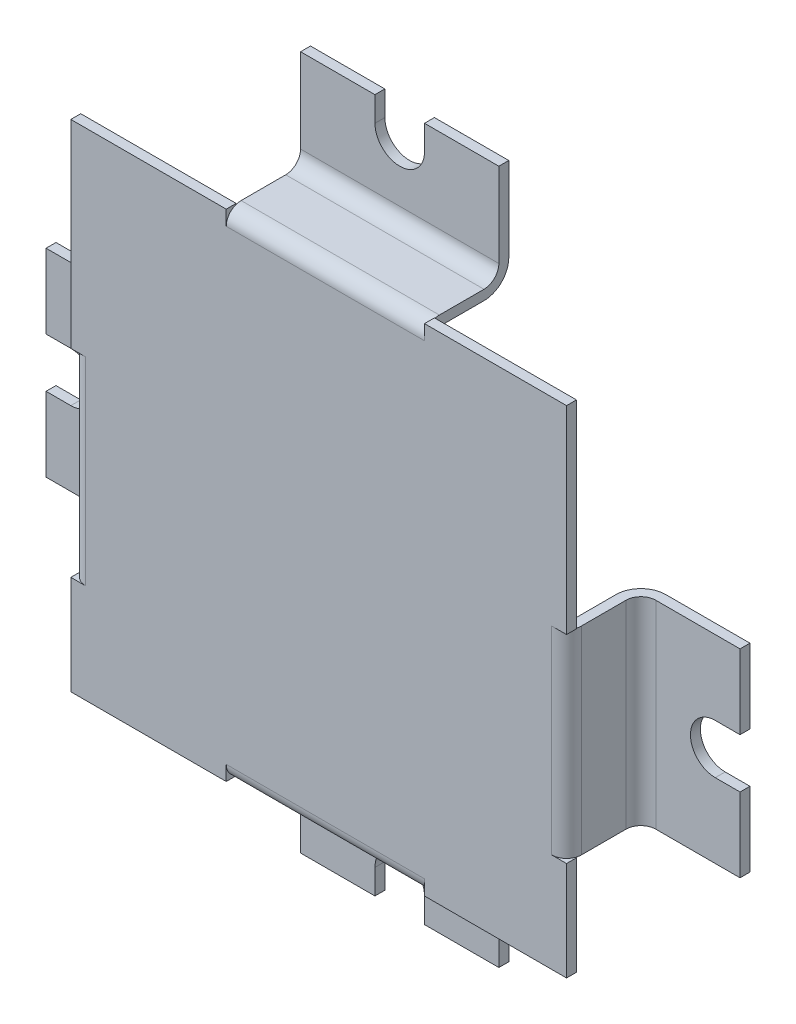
ISO-10303-21;
HEADER;
FILE_DESCRIPTION(('STEP AP214'),'2;1');
FILE_NAME('part.step','',(''),(''),'','','');
FILE_SCHEMA(('AUTOMOTIVE_DESIGN { 1 0 10303 214 1 1 1 1 }'));
ENDSEC;
DATA;
#1=APPLICATION_CONTEXT('core data for automotive mechanical design processes');
#2=APPLICATION_PROTOCOL_DEFINITION('international standard','automotive_design',2000,#1);
#3=PRODUCT_CONTEXT('',#1,'mechanical');
#4=PRODUCT('Part','Part','',(#3));
#5=PRODUCT_RELATED_PRODUCT_CATEGORY('part','',(#4));
#6=PRODUCT_DEFINITION_FORMATION('','',#4);
#7=PRODUCT_DEFINITION_CONTEXT('part definition',#1,'design');
#8=PRODUCT_DEFINITION('design','',#6,#7);
#9=PRODUCT_DEFINITION_SHAPE('','',#8);
#10=(LENGTH_UNIT() NAMED_UNIT(*) SI_UNIT(.MILLI.,.METRE.));
#11=(NAMED_UNIT(*) PLANE_ANGLE_UNIT() SI_UNIT($,.RADIAN.));
#12=(NAMED_UNIT(*) SI_UNIT($,.STERADIAN.) SOLID_ANGLE_UNIT());
#13=UNCERTAINTY_MEASURE_WITH_UNIT(LENGTH_MEASURE(1.E-05),#10,'distance_accuracy_value','');
#14=(GEOMETRIC_REPRESENTATION_CONTEXT(3) GLOBAL_UNCERTAINTY_ASSIGNED_CONTEXT((#13)) GLOBAL_UNIT_ASSIGNED_CONTEXT((#10,
#11,#12)) REPRESENTATION_CONTEXT('',''));
#15=CARTESIAN_POINT('',(0.,0.,0.));
#16=DIRECTION('',(0.,0.,1.));
#17=DIRECTION('',(1.,0.,0.));
#18=AXIS2_PLACEMENT_3D('',#15,#16,#17);
#19=CARTESIAN_POINT('',(0.,0.,-2.));
#20=DIRECTION('',(0.,0.,-1.));
#21=DIRECTION('',(-1.,0.,0.));
#22=AXIS2_PLACEMENT_3D('',#19,#20,#21);
#23=PLANE('',#22);
#24=DIRECTION('',(1.,0.,0.));
#25=VECTOR('',#24,1.);
#26=CARTESIAN_POINT('',(-18.6527814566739,-47.,-2.));
#27=LINE('',#26,#25);
#28=CARTESIAN_POINT('',(-18.6527814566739,-47.,-2.));
#29=VERTEX_POINT('',#28);
#30=CARTESIAN_POINT('',(21.3472185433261,-47.,-2.));
#31=VERTEX_POINT('',#30);
#32=EDGE_CURVE('E58',#29,#31,#27,.T.);
#33=ORIENTED_EDGE('',*,*,#32,.F.);
#34=DIRECTION('',(0.,-1.,0.));
#35=VECTOR('',#34,1.);
#36=CARTESIAN_POINT('',(-18.6527814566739,0.,-2.));
#37=LINE('',#36,#35);
#38=CARTESIAN_POINT('',(-18.6527814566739,-49.8284271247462,-2.));
#39=VERTEX_POINT('',#38);
#40=EDGE_CURVE('E603',#29,#39,#37,.T.);
#41=ORIENTED_EDGE('',*,*,#40,.T.);
#42=DIRECTION('',(0.,-1.,0.));
#43=VECTOR('',#42,1.);
#44=CARTESIAN_POINT('',(-18.6527814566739,0.,-2.));
#45=LINE('',#44,#43);
#46=CARTESIAN_POINT('',(-18.6527814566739,-50.,-2.));
#47=VERTEX_POINT('',#46);
#48=EDGE_CURVE('E615',#39,#47,#45,.T.);
#49=ORIENTED_EDGE('',*,*,#48,.T.);
#50=DIRECTION('',(1.,0.,0.));
#51=VECTOR('',#50,1.);
#52=CARTESIAN_POINT('',(-50.,-50.,-2.));
#53=LINE('',#52,#51);
#54=CARTESIAN_POINT('',(-50.,-50.,-2.));
#55=VERTEX_POINT('',#54);
#56=EDGE_CURVE('E1014',#55,#47,#53,.T.);
#57=ORIENTED_EDGE('',*,*,#56,.F.);
#58=DIRECTION('',(0.,-1.,0.));
#59=VECTOR('',#58,1.);
#60=CARTESIAN_POINT('',(-50.,-50.,-2.));
#61=LINE('',#60,#59);
#62=CARTESIAN_POINT('',(-50.,-30.,-2.));
#63=VERTEX_POINT('',#62);
#64=EDGE_CURVE('E1013',#63,#55,#61,.T.);
#65=ORIENTED_EDGE('',*,*,#64,.F.);
#66=DIRECTION('',(1.,0.,0.));
#67=VECTOR('',#66,1.);
#68=CARTESIAN_POINT('',(0.,-30.,-2.));
#69=LINE('',#68,#67);
#70=CARTESIAN_POINT('',(-49.828427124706,-30.,-2.));
#71=VERTEX_POINT('',#70);
#72=EDGE_CURVE('E869',#63,#71,#69,.T.);
#73=ORIENTED_EDGE('',*,*,#72,.T.);
#74=DIRECTION('',(1.,0.,0.));
#75=VECTOR('',#74,1.);
#76=CARTESIAN_POINT('',(0.,-30.,-2.));
#77=LINE('',#76,#75);
#78=CARTESIAN_POINT('',(-47.,-30.,-2.00000000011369));
#79=VERTEX_POINT('',#78);
#80=EDGE_CURVE('E851',#71,#79,#77,.T.);
#81=ORIENTED_EDGE('',*,*,#80,.T.);
#82=DIRECTION('',(0.,-1.,0.));
#83=VECTOR('',#82,1.);
#84=CARTESIAN_POINT('',(-47.,9.99999999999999,-2.00000000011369));
#85=LINE('',#84,#83);
#86=CARTESIAN_POINT('',(-47.,9.99999999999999,-2.00000000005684));
#87=VERTEX_POINT('',#86);
#88=EDGE_CURVE('E807',#87,#79,#85,.T.);
#89=ORIENTED_EDGE('',*,*,#88,.F.);
#90=DIRECTION('',(-1.,0.,0.));
#91=VECTOR('',#90,1.);
#92=CARTESIAN_POINT('',(0.,9.99999999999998,-2.));
#93=LINE('',#92,#91);
#94=CARTESIAN_POINT('',(-49.828427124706,10.,-2.));
#95=VERTEX_POINT('',#94);
#96=EDGE_CURVE('E853',#87,#95,#93,.T.);
#97=ORIENTED_EDGE('',*,*,#96,.T.);
#98=DIRECTION('',(-1.,0.,0.));
#99=VECTOR('',#98,1.);
#100=CARTESIAN_POINT('',(0.,9.99999999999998,-2.));
#101=LINE('',#100,#99);
#102=CARTESIAN_POINT('',(-50.,9.99999999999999,-2.));
#103=VERTEX_POINT('',#102);
#104=EDGE_CURVE('E866',#95,#103,#101,.T.);
#105=ORIENTED_EDGE('',*,*,#104,.T.);
#106=CARTESIAN_POINT('',(-50.,50.,-2.));
#107=VERTEX_POINT('',#106);
#108=EDGE_CURVE('E1009',#107,#103,#61,.T.);
#109=ORIENTED_EDGE('',*,*,#108,.F.);
#110=DIRECTION('',(-1.,0.,0.));
#111=VECTOR('',#110,1.);
#112=CARTESIAN_POINT('',(-50.,50.,-2.));
#113=LINE('',#112,#111);
#114=CARTESIAN_POINT('',(-18.6527814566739,50.,-2.));
#115=VERTEX_POINT('',#114);
#116=EDGE_CURVE('E1021',#115,#107,#113,.T.);
#117=ORIENTED_EDGE('',*,*,#116,.F.);
#118=DIRECTION('',(0.,-1.,0.));
#119=VECTOR('',#118,1.);
#120=CARTESIAN_POINT('',(-18.6527814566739,0.,-2.));
#121=LINE('',#120,#119);
#122=CARTESIAN_POINT('',(-18.6527814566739,49.8284271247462,-2.));
#123=VERTEX_POINT('',#122);
#124=EDGE_CURVE('E747',#115,#123,#121,.T.);
#125=ORIENTED_EDGE('',*,*,#124,.T.);
#126=DIRECTION('',(0.,1.,0.));
#127=VECTOR('',#126,1.);
#128=CARTESIAN_POINT('',(-18.6527814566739,0.,-2.));
#129=LINE('',#128,#127);
#130=CARTESIAN_POINT('',(-18.6527814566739,47.,-2.));
#131=VERTEX_POINT('',#130);
#132=EDGE_CURVE('E731',#123,#131,#129,.F.);
#133=ORIENTED_EDGE('',*,*,#132,.T.);
#134=DIRECTION('',(1.,0.,0.));
#135=VECTOR('',#134,1.);
#136=CARTESIAN_POINT('',(-18.6527814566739,47.,-2.));
#137=LINE('',#136,#135);
#138=CARTESIAN_POINT('',(21.3472185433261,47.,-2.));
#139=VERTEX_POINT('',#138);
#140=EDGE_CURVE('E704',#131,#139,#137,.T.);
#141=ORIENTED_EDGE('',*,*,#140,.T.);
#142=DIRECTION('',(0.,1.,0.));
#143=VECTOR('',#142,1.);
#144=CARTESIAN_POINT('',(21.3472185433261,0.,-2.));
#145=LINE('',#144,#143);
#146=CARTESIAN_POINT('',(21.3472185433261,49.8284271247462,-2.));
#147=VERTEX_POINT('',#146);
#148=EDGE_CURVE('E728',#139,#147,#145,.T.);
#149=ORIENTED_EDGE('',*,*,#148,.T.);
#150=DIRECTION('',(0.,1.,0.));
#151=VECTOR('',#150,1.);
#152=CARTESIAN_POINT('',(21.3472185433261,0.,-2.));
#153=LINE('',#152,#151);
#154=CARTESIAN_POINT('',(21.3472185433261,50.,-2.));
#155=VERTEX_POINT('',#154);
#156=EDGE_CURVE('E750',#147,#155,#153,.T.);
#157=ORIENTED_EDGE('',*,*,#156,.T.);
#158=CARTESIAN_POINT('',(50.,50.,-2.));
#159=VERTEX_POINT('',#158);
#160=EDGE_CURVE('E1022',#159,#155,#113,.T.);
#161=ORIENTED_EDGE('',*,*,#160,.F.);
#162=DIRECTION('',(0.,1.,0.));
#163=VECTOR('',#162,1.);
#164=CARTESIAN_POINT('',(50.,-50.,-2.));
#165=LINE('',#164,#163);
#166=CARTESIAN_POINT('',(50.,9.99999999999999,-2.));
#167=VERTEX_POINT('',#166);
#168=EDGE_CURVE('E1017',#167,#159,#165,.T.);
#169=ORIENTED_EDGE('',*,*,#168,.F.);
#170=DIRECTION('',(-1.,0.,0.));
#171=VECTOR('',#170,1.);
#172=CARTESIAN_POINT('',(0.,9.99999999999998,-2.));
#173=LINE('',#172,#171);
#174=CARTESIAN_POINT('',(49.828427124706,10.,-2.));
#175=VERTEX_POINT('',#174);
#176=EDGE_CURVE('E996',#167,#175,#173,.T.);
#177=ORIENTED_EDGE('',*,*,#176,.T.);
#178=DIRECTION('',(1.,0.,0.));
#179=VECTOR('',#178,1.);
#180=CARTESIAN_POINT('',(0.,9.99999999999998,-2.));
#181=LINE('',#180,#179);
#182=CARTESIAN_POINT('',(47.,9.99999999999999,-2.00000000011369));
#183=VERTEX_POINT('',#182);
#184=EDGE_CURVE('E982',#175,#183,#181,.F.);
#185=ORIENTED_EDGE('',*,*,#184,.T.);
#186=DIRECTION('',(0.,-1.,0.));
#187=VECTOR('',#186,1.);
#188=CARTESIAN_POINT('',(47.,9.99999999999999,-2.00000000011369));
#189=LINE('',#188,#187);
#190=CARTESIAN_POINT('',(47.,-30.,-2.00000000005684));
#191=VERTEX_POINT('',#190);
#192=EDGE_CURVE('E955',#183,#191,#189,.T.);
#193=ORIENTED_EDGE('',*,*,#192,.T.);
#194=DIRECTION('',(1.,0.,0.));
#195=VECTOR('',#194,1.);
#196=CARTESIAN_POINT('',(0.,-30.,-2.));
#197=LINE('',#196,#195);
#198=CARTESIAN_POINT('',(49.828427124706,-30.,-2.));
#199=VERTEX_POINT('',#198);
#200=EDGE_CURVE('E979',#191,#199,#197,.T.);
#201=ORIENTED_EDGE('',*,*,#200,.T.);
#202=DIRECTION('',(1.,0.,0.));
#203=VECTOR('',#202,1.);
#204=CARTESIAN_POINT('',(0.,-30.,-2.));
#205=LINE('',#204,#203);
#206=CARTESIAN_POINT('',(50.,-30.,-2.));
#207=VERTEX_POINT('',#206);
#208=EDGE_CURVE('E1002',#199,#207,#205,.T.);
#209=ORIENTED_EDGE('',*,*,#208,.T.);
#210=CARTESIAN_POINT('',(50.,-50.,-2.));
#211=VERTEX_POINT('',#210);
#212=EDGE_CURVE('E1018',#211,#207,#165,.T.);
#213=ORIENTED_EDGE('',*,*,#212,.F.);
#214=CARTESIAN_POINT('',(21.3472185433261,-50.,-2.));
#215=VERTEX_POINT('',#214);
#216=EDGE_CURVE('E1012',#215,#211,#53,.T.);
#217=ORIENTED_EDGE('',*,*,#216,.F.);
#218=DIRECTION('',(0.,1.,0.));
#219=VECTOR('',#218,1.);
#220=CARTESIAN_POINT('',(21.3472185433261,0.,-2.));
#221=LINE('',#220,#219);
#222=CARTESIAN_POINT('',(21.3472185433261,-49.8284271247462,-2.));
#223=VERTEX_POINT('',#222);
#224=EDGE_CURVE('E618',#215,#223,#221,.T.);
#225=ORIENTED_EDGE('',*,*,#224,.T.);
#226=DIRECTION('',(0.,1.,0.));
#227=VECTOR('',#226,1.);
#228=CARTESIAN_POINT('',(21.3472185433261,0.,-2.));
#229=LINE('',#228,#227);
#230=EDGE_CURVE('E601',#223,#31,#229,.T.);
#231=ORIENTED_EDGE('',*,*,#230,.T.);
#232=EDGE_LOOP('',(#33,#41,#49,#57,#65,#73,#81,#89,#97,#105,#109,#117,#125,#133,#141,#149,#157,
#161,#169,#177,#185,#193,#201,#209,#213,#217,#225,#231));
#233=FACE_BOUND('',#232,.T.);
#234=ADVANCED_FACE('F43',(#233),#23,.T.);
#235=CARTESIAN_POINT('',(0.,0.,0.));
#236=DIRECTION('',(0.,0.,-1.));
#237=DIRECTION('',(-1.,0.,0.));
#238=AXIS2_PLACEMENT_3D('',#235,#236,#237);
#239=PLANE('',#238);
#240=DIRECTION('',(0.,1.,0.));
#241=VECTOR('',#240,1.);
#242=CARTESIAN_POINT('',(21.3472185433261,-70.,0.));
#243=LINE('',#242,#241);
#244=CARTESIAN_POINT('',(21.3472185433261,-50.,0.));
#245=VERTEX_POINT('',#244);
#246=CARTESIAN_POINT('',(21.3472185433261,-47.,0.));
#247=VERTEX_POINT('',#246);
#248=EDGE_CURVE('E605',#245,#247,#243,.T.);
#249=ORIENTED_EDGE('',*,*,#248,.F.);
#250=DIRECTION('',(1.,0.,0.));
#251=VECTOR('',#250,1.);
#252=CARTESIAN_POINT('',(-50.,-50.,0.));
#253=LINE('',#252,#251);
#254=CARTESIAN_POINT('',(50.,-50.,0.));
#255=VERTEX_POINT('',#254);
#256=EDGE_CURVE('E1029',#245,#255,#253,.T.);
#257=ORIENTED_EDGE('',*,*,#256,.T.);
#258=DIRECTION('',(0.,1.,0.));
#259=VECTOR('',#258,1.);
#260=CARTESIAN_POINT('',(50.,-50.,0.));
#261=LINE('',#260,#259);
#262=CARTESIAN_POINT('',(50.,-30.,-1.13686837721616E-10));
#263=VERTEX_POINT('',#262);
#264=EDGE_CURVE('E1034',#255,#263,#261,.T.);
#265=ORIENTED_EDGE('',*,*,#264,.T.);
#266=DIRECTION('',(1.,0.,0.));
#267=VECTOR('',#266,1.);
#268=CARTESIAN_POINT('',(0.,-30.,0.));
#269=LINE('',#268,#267);
#270=CARTESIAN_POINT('',(47.,-30.,-1.13686837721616E-10));
#271=VERTEX_POINT('',#270);
#272=EDGE_CURVE('E1044',#271,#263,#269,.T.);
#273=ORIENTED_EDGE('',*,*,#272,.F.);
#274=DIRECTION('',(0.,1.,0.));
#275=VECTOR('',#274,1.);
#276=CARTESIAN_POINT('',(47.,-30.,-1.13686837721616E-10));
#277=LINE('',#276,#275);
#278=CARTESIAN_POINT('',(47.,9.99999999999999,-5.6843852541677E-11));
#279=VERTEX_POINT('',#278);
#280=EDGE_CURVE('E988',#279,#271,#277,.F.);
#281=ORIENTED_EDGE('',*,*,#280,.F.);
#282=DIRECTION('',(1.,0.,0.));
#283=VECTOR('',#282,1.);
#284=CARTESIAN_POINT('',(70.,10.,-1.13686837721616E-10));
#285=LINE('',#284,#283);
#286=CARTESIAN_POINT('',(50.,9.99999999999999,-1.13686837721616E-10));
#287=VERTEX_POINT('',#286);
#288=EDGE_CURVE('E985',#279,#287,#285,.T.);
#289=ORIENTED_EDGE('',*,*,#288,.T.);
#290=CARTESIAN_POINT('',(50.,50.,0.));
#291=VERTEX_POINT('',#290);
#292=EDGE_CURVE('E1033',#287,#291,#261,.T.);
#293=ORIENTED_EDGE('',*,*,#292,.T.);
#294=DIRECTION('',(-1.,0.,0.));
#295=VECTOR('',#294,1.);
#296=CARTESIAN_POINT('',(-50.,50.,0.));
#297=LINE('',#296,#295);
#298=CARTESIAN_POINT('',(21.3472185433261,50.,0.));
#299=VERTEX_POINT('',#298);
#300=EDGE_CURVE('E1038',#291,#299,#297,.T.);
#301=ORIENTED_EDGE('',*,*,#300,.T.);
#302=DIRECTION('',(0.,-1.,0.));
#303=VECTOR('',#302,1.);
#304=CARTESIAN_POINT('',(21.3472185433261,70.,0.));
#305=LINE('',#304,#303);
#306=CARTESIAN_POINT('',(21.3472185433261,47.,0.));
#307=VERTEX_POINT('',#306);
#308=EDGE_CURVE('E735',#299,#307,#305,.T.);
#309=ORIENTED_EDGE('',*,*,#308,.T.);
#310=DIRECTION('',(-1.,0.,0.));
#311=VECTOR('',#310,1.);
#312=CARTESIAN_POINT('',(21.3472185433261,47.,0.));
#313=LINE('',#312,#311);
#314=CARTESIAN_POINT('',(-18.6527814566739,47.,0.));
#315=VERTEX_POINT('',#314);
#316=EDGE_CURVE('E738',#315,#307,#313,.F.);
#317=ORIENTED_EDGE('',*,*,#316,.F.);
#318=DIRECTION('',(0.,1.,0.));
#319=VECTOR('',#318,1.);
#320=CARTESIAN_POINT('',(-18.6527814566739,70.,0.));
#321=LINE('',#320,#319);
#322=CARTESIAN_POINT('',(-18.6527814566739,50.,0.));
#323=VERTEX_POINT('',#322);
#324=EDGE_CURVE('E734',#315,#323,#321,.T.);
#325=ORIENTED_EDGE('',*,*,#324,.T.);
#326=CARTESIAN_POINT('',(-50.,50.,0.));
#327=VERTEX_POINT('',#326);
#328=EDGE_CURVE('E1037',#323,#327,#297,.T.);
#329=ORIENTED_EDGE('',*,*,#328,.T.);
#330=DIRECTION('',(0.,-1.,0.));
#331=VECTOR('',#330,1.);
#332=CARTESIAN_POINT('',(-50.,-50.,0.));
#333=LINE('',#332,#331);
#334=CARTESIAN_POINT('',(-50.,9.99999999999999,0.));
#335=VERTEX_POINT('',#334);
#336=EDGE_CURVE('E1026',#327,#335,#333,.T.);
#337=ORIENTED_EDGE('',*,*,#336,.T.);
#338=DIRECTION('',(-1.,0.,0.));
#339=VECTOR('',#338,1.);
#340=CARTESIAN_POINT('',(-70.,10.,-1.13686837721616E-10));
#341=LINE('',#340,#339);
#342=CARTESIAN_POINT('',(-47.,9.99999999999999,-1.13686837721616E-10));
#343=VERTEX_POINT('',#342);
#344=EDGE_CURVE('E855',#343,#335,#341,.T.);
#345=ORIENTED_EDGE('',*,*,#344,.F.);
#346=DIRECTION('',(0.,1.,0.));
#347=VECTOR('',#346,1.);
#348=CARTESIAN_POINT('',(-47.,-30.,-1.13686837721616E-10));
#349=LINE('',#348,#347);
#350=CARTESIAN_POINT('',(-47.,-30.,-1.13686837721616E-10));
#351=VERTEX_POINT('',#350);
#352=EDGE_CURVE('E858',#343,#351,#349,.F.);
#353=ORIENTED_EDGE('',*,*,#352,.T.);
#354=DIRECTION('',(1.,0.,0.));
#355=VECTOR('',#354,1.);
#356=CARTESIAN_POINT('',(-70.,-30.,-1.13686837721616E-10));
#357=LINE('',#356,#355);
#358=CARTESIAN_POINT('',(-50.,-30.,-1.13686837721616E-10));
#359=VERTEX_POINT('',#358);
#360=EDGE_CURVE('E856',#359,#351,#357,.T.);
#361=ORIENTED_EDGE('',*,*,#360,.F.);
#362=CARTESIAN_POINT('',(-50.,-50.,0.));
#363=VERTEX_POINT('',#362);
#364=EDGE_CURVE('E1008',#359,#363,#333,.T.);
#365=ORIENTED_EDGE('',*,*,#364,.T.);
#366=CARTESIAN_POINT('',(-18.6527814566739,-50.,0.));
#367=VERTEX_POINT('',#366);
#368=EDGE_CURVE('E1030',#363,#367,#253,.T.);
#369=ORIENTED_EDGE('',*,*,#368,.T.);
#370=DIRECTION('',(0.,-1.,0.));
#371=VECTOR('',#370,1.);
#372=CARTESIAN_POINT('',(-18.6527814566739,-70.,0.));
#373=LINE('',#372,#371);
#374=CARTESIAN_POINT('',(-18.6527814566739,-47.,0.));
#375=VERTEX_POINT('',#374);
#376=EDGE_CURVE('E66',#375,#367,#373,.T.);
#377=ORIENTED_EDGE('',*,*,#376,.F.);
#378=DIRECTION('',(-1.,0.,0.));
#379=VECTOR('',#378,1.);
#380=CARTESIAN_POINT('',(21.3472185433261,-47.,0.));
#381=LINE('',#380,#379);
#382=EDGE_CURVE('E607',#375,#247,#381,.F.);
#383=ORIENTED_EDGE('',*,*,#382,.T.);
#384=EDGE_LOOP('',(#249,#257,#265,#273,#281,#289,#293,#301,#309,#317,#325,#329,#337,#345,#353,
#361,#365,#369,#377,#383));
#385=FACE_BOUND('',#384,.T.);
#386=ADVANCED_FACE('F1073',(#385),#239,.F.);
#387=CARTESIAN_POINT('',(-50.,-50.,-2.));
#388=DIRECTION('',(0.,-1.,0.));
#389=DIRECTION('',(0.,0.,-1.));
#390=AXIS2_PLACEMENT_3D('',#387,#388,#389);
#391=PLANE('',#390);
#392=ORIENTED_EDGE('',*,*,#256,.F.);
#393=DIRECTION('',(0.,0.,-1.));
#394=VECTOR('',#393,1.);
#395=CARTESIAN_POINT('',(21.3472185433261,-50.,-2.));
#396=LINE('',#395,#394);
#397=EDGE_CURVE('E12',#245,#215,#396,.T.);
#398=ORIENTED_EDGE('',*,*,#397,.T.);
#399=ORIENTED_EDGE('',*,*,#216,.T.);
#400=DIRECTION('',(0.,0.,1.));
#401=VECTOR('',#400,1.);
#402=CARTESIAN_POINT('',(50.,-50.,-2.));
#403=LINE('',#402,#401);
#404=EDGE_CURVE('E1048',#211,#255,#403,.T.);
#405=ORIENTED_EDGE('',*,*,#404,.T.);
#406=EDGE_LOOP('',(#392,#398,#399,#405));
#407=FACE_BOUND('',#406,.T.);
#408=ADVANCED_FACE('F1107',(#407),#391,.T.);
#409=ORIENTED_EDGE('',*,*,#56,.T.);
#410=DIRECTION('',(0.,0.,1.));
#411=VECTOR('',#410,1.);
#412=CARTESIAN_POINT('',(-18.6527814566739,-50.,-2.));
#413=LINE('',#412,#411);
#414=EDGE_CURVE('E51',#47,#367,#413,.T.);
#415=ORIENTED_EDGE('',*,*,#414,.T.);
#416=ORIENTED_EDGE('',*,*,#368,.F.);
#417=DIRECTION('',(0.,0.,1.));
#418=VECTOR('',#417,1.);
#419=CARTESIAN_POINT('',(-50.,-50.,-2.));
#420=LINE('',#419,#418);
#421=EDGE_CURVE('E1025',#55,#363,#420,.T.);
#422=ORIENTED_EDGE('',*,*,#421,.F.);
#423=EDGE_LOOP('',(#409,#415,#416,#422));
#424=FACE_BOUND('',#423,.T.);
#425=ADVANCED_FACE('F1067',(#424),#391,.T.);
#426=CARTESIAN_POINT('',(-50.,50.,-2.));
#427=DIRECTION('',(0.,1.,0.));
#428=DIRECTION('',(0.,0.,1.));
#429=AXIS2_PLACEMENT_3D('',#426,#427,#428);
#430=PLANE('',#429);
#431=ORIENTED_EDGE('',*,*,#160,.T.);
#432=DIRECTION('',(0.,0.,1.));
#433=VECTOR('',#432,1.);
#434=CARTESIAN_POINT('',(21.3472185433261,50.,-2.));
#435=LINE('',#434,#433);
#436=EDGE_CURVE('E1063',#155,#299,#435,.T.);
#437=ORIENTED_EDGE('',*,*,#436,.T.);
#438=ORIENTED_EDGE('',*,*,#300,.F.);
#439=DIRECTION('',(0.,0.,1.));
#440=VECTOR('',#439,1.);
#441=CARTESIAN_POINT('',(50.,50.,-2.));
#442=LINE('',#441,#440);
#443=EDGE_CURVE('E1045',#159,#291,#442,.T.);
#444=ORIENTED_EDGE('',*,*,#443,.F.);
#445=EDGE_LOOP('',(#431,#437,#438,#444));
#446=FACE_BOUND('',#445,.T.);
#447=ADVANCED_FACE('F1146',(#446),#430,.T.);
#448=ORIENTED_EDGE('',*,*,#328,.F.);
#449=DIRECTION('',(0.,0.,-1.));
#450=VECTOR('',#449,1.);
#451=CARTESIAN_POINT('',(-18.6527814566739,50.,-2.));
#452=LINE('',#451,#450);
#453=EDGE_CURVE('E1060',#323,#115,#452,.T.);
#454=ORIENTED_EDGE('',*,*,#453,.T.);
#455=ORIENTED_EDGE('',*,*,#116,.T.);
#456=DIRECTION('',(0.,0.,1.));
#457=VECTOR('',#456,1.);
#458=CARTESIAN_POINT('',(-50.,50.,-2.));
#459=LINE('',#458,#457);
#460=EDGE_CURVE('E1041',#107,#327,#459,.T.);
#461=ORIENTED_EDGE('',*,*,#460,.T.);
#462=EDGE_LOOP('',(#448,#454,#455,#461));
#463=FACE_BOUND('',#462,.T.);
#464=ADVANCED_FACE('F1162',(#463),#430,.T.);
#465=CARTESIAN_POINT('',(-50.,-50.,-2.));
#466=DIRECTION('',(-1.,0.,0.));
#467=DIRECTION('',(0.,0.,1.));
#468=AXIS2_PLACEMENT_3D('',#465,#466,#467);
#469=PLANE('',#468);
#470=ORIENTED_EDGE('',*,*,#364,.F.);
#471=DIRECTION('',(0.,0.,-1.));
#472=VECTOR('',#471,1.);
#473=CARTESIAN_POINT('',(-50.,-30.,-2.));
#474=LINE('',#473,#472);
#475=EDGE_CURVE('E1057',#359,#63,#474,.T.);
#476=ORIENTED_EDGE('',*,*,#475,.T.);
#477=ORIENTED_EDGE('',*,*,#64,.T.);
#478=ORIENTED_EDGE('',*,*,#421,.T.);
#479=EDGE_LOOP('',(#470,#476,#477,#478));
#480=FACE_BOUND('',#479,.T.);
#481=ADVANCED_FACE('F45',(#480),#469,.T.);
#482=ORIENTED_EDGE('',*,*,#108,.T.);
#483=DIRECTION('',(0.,0.,1.));
#484=VECTOR('',#483,1.);
#485=CARTESIAN_POINT('',(-50.,9.99999999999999,-2.));
#486=LINE('',#485,#484);
#487=EDGE_CURVE('E1054',#103,#335,#486,.T.);
#488=ORIENTED_EDGE('',*,*,#487,.T.);
#489=ORIENTED_EDGE('',*,*,#336,.F.);
#490=ORIENTED_EDGE('',*,*,#460,.F.);
#491=EDGE_LOOP('',(#482,#488,#489,#490));
#492=FACE_BOUND('',#491,.T.);
#493=ADVANCED_FACE('F1168',(#492),#469,.T.);
#494=CARTESIAN_POINT('',(50.,-50.,-2.));
#495=DIRECTION('',(1.,0.,0.));
#496=DIRECTION('',(0.,0.,-1.));
#497=AXIS2_PLACEMENT_3D('',#494,#495,#496);
#498=PLANE('',#497);
#499=ORIENTED_EDGE('',*,*,#212,.T.);
#500=DIRECTION('',(0.,0.,1.));
#501=VECTOR('',#500,1.);
#502=CARTESIAN_POINT('',(50.,-30.,-2.));
#503=LINE('',#502,#501);
#504=EDGE_CURVE('E1005',#207,#263,#503,.T.);
#505=ORIENTED_EDGE('',*,*,#504,.T.);
#506=ORIENTED_EDGE('',*,*,#264,.F.);
#507=ORIENTED_EDGE('',*,*,#404,.F.);
#508=EDGE_LOOP('',(#499,#505,#506,#507));
#509=FACE_BOUND('',#508,.T.);
#510=ADVANCED_FACE('F1113',(#509),#498,.T.);
#511=ORIENTED_EDGE('',*,*,#292,.F.);
#512=DIRECTION('',(0.,0.,-1.));
#513=VECTOR('',#512,1.);
#514=CARTESIAN_POINT('',(50.,9.99999999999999,-2.));
#515=LINE('',#514,#513);
#516=EDGE_CURVE('E999',#287,#167,#515,.T.);
#517=ORIENTED_EDGE('',*,*,#516,.T.);
#518=ORIENTED_EDGE('',*,*,#168,.T.);
#519=ORIENTED_EDGE('',*,*,#443,.T.);
#520=EDGE_LOOP('',(#511,#517,#518,#519));
#521=FACE_BOUND('',#520,.T.);
#522=ADVANCED_FACE('F1143',(#521),#498,.T.);
#523=CARTESIAN_POINT('',(70.,-30.,-15.0000000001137));
#524=DIRECTION('',(0.,1.,0.));
#525=DIRECTION('',(0.,0.,-1.));
#526=AXIS2_PLACEMENT_3D('',#523,#524,#525);
#527=PLANE('',#526);
#528=ORIENTED_EDGE('',*,*,#208,.F.);
#529=CARTESIAN_POINT('',(47.,-30.,-3.00000000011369));
#530=DIRECTION('',(0.,1.,0.));
#531=DIRECTION('',(0.,0.,-1.));
#532=AXIS2_PLACEMENT_3D('',#529,#530,#531);
#533=CIRCLE('',#532,3.);
#534=EDGE_CURVE('E993',#271,#199,#533,.T.);
#535=ORIENTED_EDGE('',*,*,#534,.F.);
#536=ORIENTED_EDGE('',*,*,#272,.T.);
#537=ORIENTED_EDGE('',*,*,#504,.F.);
#538=EDGE_LOOP('',(#528,#535,#536,#537));
#539=FACE_BOUND('',#538,.T.);
#540=ADVANCED_FACE('F1116',(#539),#527,.T.);
#541=CARTESIAN_POINT('',(70.,10.,-15.0000000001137));
#542=DIRECTION('',(0.,-1.,0.));
#543=DIRECTION('',(-1.,0.,0.));
#544=AXIS2_PLACEMENT_3D('',#541,#542,#543);
#545=PLANE('',#544);
#546=ORIENTED_EDGE('',*,*,#288,.F.);
#547=CARTESIAN_POINT('',(47.,9.99999999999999,-3.00000000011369));
#548=DIRECTION('',(0.,-1.,0.));
#549=DIRECTION('',(-1.,0.,0.));
#550=AXIS2_PLACEMENT_3D('',#547,#548,#549);
#551=CIRCLE('',#550,3.);
#552=EDGE_CURVE('E990',#175,#279,#551,.T.);
#553=ORIENTED_EDGE('',*,*,#552,.F.);
#554=ORIENTED_EDGE('',*,*,#176,.F.);
#555=ORIENTED_EDGE('',*,*,#516,.F.);
#556=EDGE_LOOP('',(#546,#553,#554,#555));
#557=FACE_BOUND('',#556,.T.);
#558=ADVANCED_FACE('F1137',(#557),#545,.T.);
#559=CARTESIAN_POINT('',(47.,9.99999999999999,-3.00000000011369));
#560=DIRECTION('',(0.,-1.,0.));
#561=DIRECTION('',(0.,0.,1.));
#562=AXIS2_PLACEMENT_3D('',#559,#560,#561);
#563=CYLINDRICAL_SURFACE('',#562,3.);
#564=ORIENTED_EDGE('',*,*,#552,.T.);
#565=ORIENTED_EDGE('',*,*,#280,.T.);
#566=ORIENTED_EDGE('',*,*,#534,.T.);
#567=CARTESIAN_POINT('',(47.,-30.,-3.00000000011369));
#568=DIRECTION('',(0.,1.,0.));
#569=DIRECTION('',(0.,0.,-1.));
#570=AXIS2_PLACEMENT_3D('',#567,#568,#569);
#571=CIRCLE('',#570,3.);
#572=CARTESIAN_POINT('',(50.,-30.,-3.00000000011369));
#573=VERTEX_POINT('',#572);
#574=EDGE_CURVE('E905',#199,#573,#571,.T.);
#575=ORIENTED_EDGE('',*,*,#574,.T.);
#576=DIRECTION('',(0.,1.,0.));
#577=VECTOR('',#576,1.);
#578=CARTESIAN_POINT('',(50.,9.99999999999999,-3.00000000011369));
#579=LINE('',#578,#577);
#580=CARTESIAN_POINT('',(50.,9.99999999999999,-3.00000000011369));
#581=VERTEX_POINT('',#580);
#582=EDGE_CURVE('E898',#573,#581,#579,.T.);
#583=ORIENTED_EDGE('',*,*,#582,.T.);
#584=CARTESIAN_POINT('',(47.,9.99999999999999,-3.00000000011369));
#585=DIRECTION('',(0.,-1.,0.));
#586=DIRECTION('',(-1.,0.,0.));
#587=AXIS2_PLACEMENT_3D('',#584,#585,#586);
#588=CIRCLE('',#587,3.);
#589=EDGE_CURVE('E907',#581,#175,#588,.T.);
#590=ORIENTED_EDGE('',*,*,#589,.T.);
#591=EDGE_LOOP('',(#564,#565,#566,#575,#583,#590));
#592=FACE_BOUND('',#591,.T.);
#593=ADVANCED_FACE('F1127',(#592),#563,.T.);
#594=CARTESIAN_POINT('',(70.,10.,-15.0000000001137));
#595=DIRECTION('',(0.,1.,0.));
#596=DIRECTION('',(1.,0.,0.));
#597=AXIS2_PLACEMENT_3D('',#594,#595,#596);
#598=PLANE('',#597);
#599=ORIENTED_EDGE('',*,*,#184,.F.);
#600=ORIENTED_EDGE('',*,*,#589,.F.);
#601=DIRECTION('',(0.,0.,1.));
#602=VECTOR('',#601,1.);
#603=CARTESIAN_POINT('',(50.,9.99999999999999,-15.0000000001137));
#604=LINE('',#603,#602);
#605=CARTESIAN_POINT('',(50.,9.99999999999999,-12.0000000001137));
#606=VERTEX_POINT('',#605);
#607=EDGE_CURVE('E900',#606,#581,#604,.T.);
#608=ORIENTED_EDGE('',*,*,#607,.F.);
#609=CARTESIAN_POINT('',(53.,9.99999999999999,-12.0000000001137));
#610=DIRECTION('',(0.,-1.,0.));
#611=DIRECTION('',(-1.,0.,0.));
#612=AXIS2_PLACEMENT_3D('',#609,#610,#611);
#613=CIRCLE('',#612,3.);
#614=CARTESIAN_POINT('',(53.,9.99999999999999,-15.0000000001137));
#615=VERTEX_POINT('',#614);
#616=EDGE_CURVE('E913',#615,#606,#613,.F.);
#617=ORIENTED_EDGE('',*,*,#616,.F.);
#618=DIRECTION('',(1.,0.,0.));
#619=VECTOR('',#618,1.);
#620=CARTESIAN_POINT('',(70.,10.,-15.0000000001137));
#621=LINE('',#620,#619);
#622=CARTESIAN_POINT('',(70.,10.,-15.0000000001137));
#623=VERTEX_POINT('',#622);
#624=EDGE_CURVE('E889',#615,#623,#621,.T.);
#625=ORIENTED_EDGE('',*,*,#624,.T.);
#626=DIRECTION('',(0.,0.,-1.));
#627=VECTOR('',#626,1.);
#628=CARTESIAN_POINT('',(70.,10.,-15.0000000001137));
#629=LINE('',#628,#627);
#630=CARTESIAN_POINT('',(70.,10.,-17.0000000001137));
#631=VERTEX_POINT('',#630);
#632=EDGE_CURVE('E976',#631,#623,#629,.F.);
#633=ORIENTED_EDGE('',*,*,#632,.F.);
#634=DIRECTION('',(-1.,0.,0.));
#635=VECTOR('',#634,1.);
#636=CARTESIAN_POINT('',(52.,9.99999999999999,-17.0000000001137));
#637=LINE('',#636,#635);
#638=CARTESIAN_POINT('',(53.,9.99999999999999,-17.0000000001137));
#639=VERTEX_POINT('',#638);
#640=EDGE_CURVE('E923',#639,#631,#637,.F.);
#641=ORIENTED_EDGE('',*,*,#640,.F.);
#642=CARTESIAN_POINT('',(53.,9.99999999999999,-12.0000000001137));
#643=DIRECTION('',(0.,-1.,0.));
#644=DIRECTION('',(0.,0.,-1.));
#645=AXIS2_PLACEMENT_3D('',#642,#643,#644);
#646=CIRCLE('',#645,5.);
#647=CARTESIAN_POINT('',(48.,9.99999999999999,-12.0000000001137));
#648=VERTEX_POINT('',#647);
#649=EDGE_CURVE('E877',#639,#648,#646,.F.);
#650=ORIENTED_EDGE('',*,*,#649,.T.);
#651=DIRECTION('',(0.,0.,-1.));
#652=VECTOR('',#651,1.);
#653=CARTESIAN_POINT('',(48.,9.99999999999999,-15.0000000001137));
#654=LINE('',#653,#652);
#655=CARTESIAN_POINT('',(48.,9.99999999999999,-3.00000000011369));
#656=VERTEX_POINT('',#655);
#657=EDGE_CURVE('E920',#648,#656,#654,.F.);
#658=ORIENTED_EDGE('',*,*,#657,.T.);
#659=CARTESIAN_POINT('',(47.,9.99999999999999,-3.00000000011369));
#660=DIRECTION('',(0.,-1.,0.));
#661=DIRECTION('',(0.,0.,-1.));
#662=AXIS2_PLACEMENT_3D('',#659,#660,#661);
#663=CIRCLE('',#662,1.);
#664=EDGE_CURVE('E931',#656,#183,#663,.T.);
#665=ORIENTED_EDGE('',*,*,#664,.T.);
#666=EDGE_LOOP('',(#599,#600,#608,#617,#625,#633,#641,#650,#658,#665));
#667=FACE_BOUND('',#666,.T.);
#668=ADVANCED_FACE('F1134',(#667),#598,.T.);
#669=CARTESIAN_POINT('',(70.,10.,-15.0000000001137));
#670=DIRECTION('',(1.,0.,0.));
#671=DIRECTION('',(0.,-1.,0.));
#672=AXIS2_PLACEMENT_3D('',#669,#670,#671);
#673=PLANE('',#672);
#674=ORIENTED_EDGE('',*,*,#632,.T.);
#675=DIRECTION('',(0.,-1.,0.));
#676=VECTOR('',#675,1.);
#677=CARTESIAN_POINT('',(70.,10.,-15.0000000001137));
#678=LINE('',#677,#676);
#679=CARTESIAN_POINT('',(70.,-5.,-15.0000000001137));
#680=VERTEX_POINT('',#679);
#681=EDGE_CURVE('E884',#623,#680,#678,.T.);
#682=ORIENTED_EDGE('',*,*,#681,.T.);
#683=DIRECTION('',(0.,0.,-1.));
#684=VECTOR('',#683,1.);
#685=CARTESIAN_POINT('',(70.,-5.,-15.0000000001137));
#686=LINE('',#685,#684);
#687=CARTESIAN_POINT('',(70.,-5.,-17.0000000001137));
#688=VERTEX_POINT('',#687);
#689=EDGE_CURVE('E973',#688,#680,#686,.F.);
#690=ORIENTED_EDGE('',*,*,#689,.F.);
#691=DIRECTION('',(0.,1.,0.));
#692=VECTOR('',#691,1.);
#693=CARTESIAN_POINT('',(70.,-38.3859449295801,-17.0000000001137));
#694=LINE('',#693,#692);
#695=EDGE_CURVE('E945',#631,#688,#694,.F.);
#696=ORIENTED_EDGE('',*,*,#695,.F.);
#697=EDGE_LOOP('',(#674,#682,#690,#696));
#698=FACE_BOUND('',#697,.T.);
#699=ADVANCED_FACE('F1324',(#698),#673,.T.);
#700=CARTESIAN_POINT('',(52.,-5.,-15.0000000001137));
#701=DIRECTION('',(0.,-1.,0.));
#702=DIRECTION('',(-1.,0.,0.));
#703=AXIS2_PLACEMENT_3D('',#700,#701,#702);
#704=PLANE('',#703);
#705=ORIENTED_EDGE('',*,*,#689,.T.);
#706=DIRECTION('',(-1.,0.,0.));
#707=VECTOR('',#706,1.);
#708=CARTESIAN_POINT('',(52.,-5.,-15.0000000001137));
#709=LINE('',#708,#707);
#710=CARTESIAN_POINT('',(65.,-5.,-15.0000000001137));
#711=VERTEX_POINT('',#710);
#712=EDGE_CURVE('E892',#680,#711,#709,.T.);
#713=ORIENTED_EDGE('',*,*,#712,.T.);
#714=DIRECTION('',(0.,0.,-1.));
#715=VECTOR('',#714,1.);
#716=CARTESIAN_POINT('',(65.,-5.,-15.0000000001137));
#717=LINE('',#716,#715);
#718=CARTESIAN_POINT('',(65.,-5.,-17.0000000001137));
#719=VERTEX_POINT('',#718);
#720=EDGE_CURVE('E970',#719,#711,#717,.F.);
#721=ORIENTED_EDGE('',*,*,#720,.F.);
#722=DIRECTION('',(-1.,0.,0.));
#723=VECTOR('',#722,1.);
#724=CARTESIAN_POINT('',(52.,-5.,-17.0000000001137));
#725=LINE('',#724,#723);
#726=EDGE_CURVE('E942',#688,#719,#725,.T.);
#727=ORIENTED_EDGE('',*,*,#726,.F.);
#728=EDGE_LOOP('',(#705,#713,#721,#727));
#729=FACE_BOUND('',#728,.T.);
#730=ADVANCED_FACE('F1331',(#729),#704,.T.);
#731=CARTESIAN_POINT('',(65.,-10.,-15.0000000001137));
#732=DIRECTION('',(0.,0.,-1.));
#733=DIRECTION('',(-1.,0.,0.));
#734=AXIS2_PLACEMENT_3D('',#731,#732,#733);
#735=CYLINDRICAL_SURFACE('',#734,5.);
#736=ORIENTED_EDGE('',*,*,#720,.T.);
#737=CARTESIAN_POINT('',(65.,-10.,-15.0000000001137));
#738=DIRECTION('',(0.,0.,-1.));
#739=DIRECTION('',(-1.,0.,0.));
#740=AXIS2_PLACEMENT_3D('',#737,#738,#739);
#741=CIRCLE('',#740,5.);
#742=CARTESIAN_POINT('',(65.,-15.,-15.0000000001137));
#743=VERTEX_POINT('',#742);
#744=EDGE_CURVE('E873',#711,#743,#741,.F.);
#745=ORIENTED_EDGE('',*,*,#744,.T.);
#746=DIRECTION('',(0.,0.,-1.));
#747=VECTOR('',#746,1.);
#748=CARTESIAN_POINT('',(65.,-15.,-15.0000000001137));
#749=LINE('',#748,#747);
#750=CARTESIAN_POINT('',(65.,-15.,-17.0000000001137));
#751=VERTEX_POINT('',#750);
#752=EDGE_CURVE('E967',#751,#743,#749,.F.);
#753=ORIENTED_EDGE('',*,*,#752,.F.);
#754=CARTESIAN_POINT('',(65.,-10.,-17.0000000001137));
#755=DIRECTION('',(0.,0.,-1.));
#756=DIRECTION('',(-1.,0.,0.));
#757=AXIS2_PLACEMENT_3D('',#754,#755,#756);
#758=CIRCLE('',#757,5.);
#759=EDGE_CURVE('E872',#719,#751,#758,.F.);
#760=ORIENTED_EDGE('',*,*,#759,.F.);
#761=EDGE_LOOP('',(#736,#745,#753,#760));
#762=FACE_BOUND('',#761,.T.);
#763=ADVANCED_FACE('F1340',(#762),#735,.F.);
#764=CARTESIAN_POINT('',(52.,-15.,-15.0000000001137));
#765=DIRECTION('',(0.,1.,0.));
#766=DIRECTION('',(1.,0.,0.));
#767=AXIS2_PLACEMENT_3D('',#764,#765,#766);
#768=PLANE('',#767);
#769=ORIENTED_EDGE('',*,*,#752,.T.);
#770=DIRECTION('',(1.,0.,0.));
#771=VECTOR('',#770,1.);
#772=CARTESIAN_POINT('',(52.,-15.,-15.0000000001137));
#773=LINE('',#772,#771);
#774=CARTESIAN_POINT('',(70.,-15.,-15.0000000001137));
#775=VERTEX_POINT('',#774);
#776=EDGE_CURVE('E876',#743,#775,#773,.T.);
#777=ORIENTED_EDGE('',*,*,#776,.T.);
#778=DIRECTION('',(0.,0.,-1.));
#779=VECTOR('',#778,1.);
#780=CARTESIAN_POINT('',(70.,-15.,-15.0000000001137));
#781=LINE('',#780,#779);
#782=CARTESIAN_POINT('',(70.,-15.,-17.0000000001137));
#783=VERTEX_POINT('',#782);
#784=EDGE_CURVE('E964',#783,#775,#781,.F.);
#785=ORIENTED_EDGE('',*,*,#784,.F.);
#786=DIRECTION('',(-1.,0.,0.));
#787=VECTOR('',#786,1.);
#788=CARTESIAN_POINT('',(52.,-15.,-17.0000000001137));
#789=LINE('',#788,#787);
#790=EDGE_CURVE('E937',#751,#783,#789,.F.);
#791=ORIENTED_EDGE('',*,*,#790,.F.);
#792=EDGE_LOOP('',(#769,#777,#785,#791));
#793=FACE_BOUND('',#792,.T.);
#794=ADVANCED_FACE('F1348',(#793),#768,.T.);
#795=ORIENTED_EDGE('',*,*,#784,.T.);
#796=CARTESIAN_POINT('',(70.,-30.,-15.0000000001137));
#797=VERTEX_POINT('',#796);
#798=EDGE_CURVE('E880',#775,#797,#678,.T.);
#799=ORIENTED_EDGE('',*,*,#798,.T.);
#800=DIRECTION('',(0.,0.,-1.));
#801=VECTOR('',#800,1.);
#802=CARTESIAN_POINT('',(70.,-30.,-15.0000000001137));
#803=LINE('',#802,#801);
#804=CARTESIAN_POINT('',(70.,-30.,-17.0000000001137));
#805=VERTEX_POINT('',#804);
#806=EDGE_CURVE('E916',#805,#797,#803,.F.);
#807=ORIENTED_EDGE('',*,*,#806,.F.);
#808=DIRECTION('',(0.,1.,0.));
#809=VECTOR('',#808,1.);
#810=CARTESIAN_POINT('',(70.,-38.3859449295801,-17.0000000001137));
#811=LINE('',#810,#809);
#812=EDGE_CURVE('E934',#783,#805,#811,.F.);
#813=ORIENTED_EDGE('',*,*,#812,.F.);
#814=EDGE_LOOP('',(#795,#799,#807,#813));
#815=FACE_BOUND('',#814,.T.);
#816=ADVANCED_FACE('F1334',(#815),#673,.T.);
#817=CARTESIAN_POINT('',(50.,-30.,-15.0000000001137));
#818=DIRECTION('',(0.,1.,0.));
#819=DIRECTION('',(0.,0.,1.));
#820=AXIS2_PLACEMENT_3D('',#817,#818,#819);
#821=PLANE('',#820);
#822=ORIENTED_EDGE('',*,*,#200,.F.);
#823=CARTESIAN_POINT('',(47.,-30.,-3.00000000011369));
#824=DIRECTION('',(0.,-1.,0.));
#825=DIRECTION('',(0.,0.,-1.));
#826=AXIS2_PLACEMENT_3D('',#823,#824,#825);
#827=CIRCLE('',#826,1.);
#828=CARTESIAN_POINT('',(48.,-30.,-3.00000000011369));
#829=VERTEX_POINT('',#828);
#830=EDGE_CURVE('E919',#191,#829,#827,.F.);
#831=ORIENTED_EDGE('',*,*,#830,.T.);
#832=DIRECTION('',(0.,0.,-1.));
#833=VECTOR('',#832,1.);
#834=CARTESIAN_POINT('',(48.,-30.,-15.0000000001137));
#835=LINE('',#834,#833);
#836=CARTESIAN_POINT('',(48.,-30.,-12.0000000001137));
#837=VERTEX_POINT('',#836);
#838=EDGE_CURVE('E927',#837,#829,#835,.F.);
#839=ORIENTED_EDGE('',*,*,#838,.F.);
#840=CARTESIAN_POINT('',(53.,-30.,-12.0000000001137));
#841=DIRECTION('',(0.,-1.,0.));
#842=DIRECTION('',(0.,0.,-1.));
#843=AXIS2_PLACEMENT_3D('',#840,#841,#842);
#844=CIRCLE('',#843,5.);
#845=CARTESIAN_POINT('',(53.,-30.,-17.0000000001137));
#846=VERTEX_POINT('',#845);
#847=EDGE_CURVE('E928',#837,#846,#844,.T.);
#848=ORIENTED_EDGE('',*,*,#847,.T.);
#849=DIRECTION('',(-1.,0.,0.));
#850=VECTOR('',#849,1.);
#851=CARTESIAN_POINT('',(52.,-30.,-17.0000000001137));
#852=LINE('',#851,#850);
#853=EDGE_CURVE('E924',#805,#846,#852,.T.);
#854=ORIENTED_EDGE('',*,*,#853,.F.);
#855=ORIENTED_EDGE('',*,*,#806,.T.);
#856=DIRECTION('',(-1.,0.,0.));
#857=VECTOR('',#856,1.);
#858=CARTESIAN_POINT('',(70.,-30.,-15.0000000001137));
#859=LINE('',#858,#857);
#860=CARTESIAN_POINT('',(53.,-30.,-15.0000000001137));
#861=VERTEX_POINT('',#860);
#862=EDGE_CURVE('E883',#797,#861,#859,.T.);
#863=ORIENTED_EDGE('',*,*,#862,.T.);
#864=CARTESIAN_POINT('',(53.,-30.,-12.0000000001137));
#865=DIRECTION('',(0.,1.,0.));
#866=DIRECTION('',(0.,0.,-1.));
#867=AXIS2_PLACEMENT_3D('',#864,#865,#866);
#868=CIRCLE('',#867,3.);
#869=CARTESIAN_POINT('',(50.,-30.,-12.0000000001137));
#870=VERTEX_POINT('',#869);
#871=EDGE_CURVE('E910',#870,#861,#868,.F.);
#872=ORIENTED_EDGE('',*,*,#871,.F.);
#873=DIRECTION('',(0.,0.,1.));
#874=VECTOR('',#873,1.);
#875=CARTESIAN_POINT('',(50.,-30.,-15.0000000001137));
#876=LINE('',#875,#874);
#877=EDGE_CURVE('E895',#870,#573,#876,.T.);
#878=ORIENTED_EDGE('',*,*,#877,.T.);
#879=ORIENTED_EDGE('',*,*,#574,.F.);
#880=EDGE_LOOP('',(#822,#831,#839,#848,#854,#855,#863,#872,#878,#879));
#881=FACE_BOUND('',#880,.T.);
#882=ADVANCED_FACE('F1121',(#881),#821,.F.);
#883=CARTESIAN_POINT('',(53.,-38.3859449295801,-12.0000000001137));
#884=DIRECTION('',(0.,-1.,0.));
#885=DIRECTION('',(0.,0.,1.));
#886=AXIS2_PLACEMENT_3D('',#883,#884,#885);
#887=CYLINDRICAL_SURFACE('',#886,3.);
#888=ORIENTED_EDGE('',*,*,#871,.T.);
#889=DIRECTION('',(0.,1.,0.));
#890=VECTOR('',#889,1.);
#891=CARTESIAN_POINT('',(53.,9.99999999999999,-15.0000000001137));
#892=LINE('',#891,#890);
#893=EDGE_CURVE('E887',#861,#615,#892,.T.);
#894=ORIENTED_EDGE('',*,*,#893,.T.);
#895=ORIENTED_EDGE('',*,*,#616,.T.);
#896=DIRECTION('',(0.,1.,0.));
#897=VECTOR('',#896,1.);
#898=CARTESIAN_POINT('',(50.,-30.,-12.0000000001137));
#899=LINE('',#898,#897);
#900=EDGE_CURVE('E903',#606,#870,#899,.F.);
#901=ORIENTED_EDGE('',*,*,#900,.T.);
#902=EDGE_LOOP('',(#888,#894,#895,#901));
#903=FACE_BOUND('',#902,.T.);
#904=ADVANCED_FACE('F1369',(#903),#887,.F.);
#905=CARTESIAN_POINT('',(50.,9.99999999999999,-15.0000000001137));
#906=DIRECTION('',(1.,0.,0.));
#907=DIRECTION('',(0.,0.,-1.));
#908=AXIS2_PLACEMENT_3D('',#905,#906,#907);
#909=PLANE('',#908);
#910=ORIENTED_EDGE('',*,*,#877,.F.);
#911=ORIENTED_EDGE('',*,*,#900,.F.);
#912=ORIENTED_EDGE('',*,*,#607,.T.);
#913=ORIENTED_EDGE('',*,*,#582,.F.);
#914=EDGE_LOOP('',(#910,#911,#912,#913));
#915=FACE_BOUND('',#914,.T.);
#916=ADVANCED_FACE('F1129',(#915),#909,.T.);
#917=CARTESIAN_POINT('',(52.,-38.3859449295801,-15.0000000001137));
#918=DIRECTION('',(0.,0.,-1.));
#919=DIRECTION('',(-1.,0.,0.));
#920=AXIS2_PLACEMENT_3D('',#917,#918,#919);
#921=PLANE('',#920);
#922=ORIENTED_EDGE('',*,*,#744,.F.);
#923=ORIENTED_EDGE('',*,*,#712,.F.);
#924=ORIENTED_EDGE('',*,*,#681,.F.);
#925=ORIENTED_EDGE('',*,*,#624,.F.);
#926=ORIENTED_EDGE('',*,*,#893,.F.);
#927=ORIENTED_EDGE('',*,*,#862,.F.);
#928=ORIENTED_EDGE('',*,*,#798,.F.);
#929=ORIENTED_EDGE('',*,*,#776,.F.);
#930=EDGE_LOOP('',(#922,#923,#924,#925,#926,#927,#928,#929));
#931=FACE_BOUND('',#930,.T.);
#932=ADVANCED_FACE('F1383',(#931),#921,.F.);
#933=CARTESIAN_POINT('',(53.,-38.3859449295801,-12.0000000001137));
#934=DIRECTION('',(0.,-1.,0.));
#935=DIRECTION('',(0.,0.,1.));
#936=AXIS2_PLACEMENT_3D('',#933,#934,#935);
#937=CYLINDRICAL_SURFACE('',#936,5.);
#938=ORIENTED_EDGE('',*,*,#847,.F.);
#939=DIRECTION('',(0.,1.,0.));
#940=VECTOR('',#939,1.);
#941=CARTESIAN_POINT('',(48.,9.99999999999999,-12.0000000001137));
#942=LINE('',#941,#940);
#943=EDGE_CURVE('E917',#648,#837,#942,.F.);
#944=ORIENTED_EDGE('',*,*,#943,.F.);
#945=ORIENTED_EDGE('',*,*,#649,.F.);
#946=DIRECTION('',(0.,1.,0.));
#947=VECTOR('',#946,1.);
#948=CARTESIAN_POINT('',(53.,-38.3859449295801,-17.0000000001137));
#949=LINE('',#948,#947);
#950=EDGE_CURVE('E921',#846,#639,#949,.T.);
#951=ORIENTED_EDGE('',*,*,#950,.F.);
#952=EDGE_LOOP('',(#938,#944,#945,#951));
#953=FACE_BOUND('',#952,.T.);
#954=ADVANCED_FACE('F1390',(#953),#937,.T.);
#955=CARTESIAN_POINT('',(47.,9.99999999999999,-3.00000000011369));
#956=DIRECTION('',(0.,-1.,0.));
#957=DIRECTION('',(0.,0.,1.));
#958=AXIS2_PLACEMENT_3D('',#955,#956,#957);
#959=CYLINDRICAL_SURFACE('',#958,1.);
#960=ORIENTED_EDGE('',*,*,#830,.F.);
#961=ORIENTED_EDGE('',*,*,#192,.F.);
#962=ORIENTED_EDGE('',*,*,#664,.F.);
#963=DIRECTION('',(0.,1.,0.));
#964=VECTOR('',#963,1.);
#965=CARTESIAN_POINT('',(48.,9.99999999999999,-3.00000000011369));
#966=LINE('',#965,#964);
#967=EDGE_CURVE('E925',#829,#656,#966,.T.);
#968=ORIENTED_EDGE('',*,*,#967,.F.);
#969=EDGE_LOOP('',(#960,#961,#962,#968));
#970=FACE_BOUND('',#969,.T.);
#971=ADVANCED_FACE('F1398',(#970),#959,.F.);
#972=CARTESIAN_POINT('',(48.,9.99999999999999,-15.0000000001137));
#973=DIRECTION('',(1.,0.,0.));
#974=DIRECTION('',(0.,0.,-1.));
#975=AXIS2_PLACEMENT_3D('',#972,#973,#974);
#976=PLANE('',#975);
#977=ORIENTED_EDGE('',*,*,#838,.T.);
#978=ORIENTED_EDGE('',*,*,#967,.T.);
#979=ORIENTED_EDGE('',*,*,#657,.F.);
#980=ORIENTED_EDGE('',*,*,#943,.T.);
#981=EDGE_LOOP('',(#977,#978,#979,#980));
#982=FACE_BOUND('',#981,.T.);
#983=ADVANCED_FACE('F1406',(#982),#976,.F.);
#984=CARTESIAN_POINT('',(52.,-38.3859449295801,-17.0000000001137));
#985=DIRECTION('',(0.,0.,-1.));
#986=DIRECTION('',(-1.,0.,0.));
#987=AXIS2_PLACEMENT_3D('',#984,#985,#986);
#988=PLANE('',#987);
#989=ORIENTED_EDGE('',*,*,#759,.T.);
#990=ORIENTED_EDGE('',*,*,#790,.T.);
#991=ORIENTED_EDGE('',*,*,#812,.T.);
#992=ORIENTED_EDGE('',*,*,#853,.T.);
#993=ORIENTED_EDGE('',*,*,#950,.T.);
#994=ORIENTED_EDGE('',*,*,#640,.T.);
#995=ORIENTED_EDGE('',*,*,#695,.T.);
#996=ORIENTED_EDGE('',*,*,#726,.T.);
#997=EDGE_LOOP('',(#989,#990,#991,#992,#993,#994,#995,#996));
#998=FACE_BOUND('',#997,.T.);
#999=ADVANCED_FACE('F1414',(#998),#988,.T.);
#1000=CARTESIAN_POINT('',(-70.,-30.,-15.0000000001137));
#1001=DIRECTION('',(0.,1.,0.));
#1002=DIRECTION('',(0.,0.,-1.));
#1003=AXIS2_PLACEMENT_3D('',#1000,#1001,#1002);
#1004=PLANE('',#1003);
#1005=ORIENTED_EDGE('',*,*,#475,.F.);
#1006=ORIENTED_EDGE('',*,*,#360,.T.);
#1007=CARTESIAN_POINT('',(-47.,-30.,-3.00000000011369));
#1008=DIRECTION('',(0.,-1.,0.));
#1009=DIRECTION('',(0.,0.,-1.));
#1010=AXIS2_PLACEMENT_3D('',#1007,#1008,#1009);
#1011=CIRCLE('',#1010,3.);
#1012=EDGE_CURVE('E864',#351,#71,#1011,.T.);
#1013=ORIENTED_EDGE('',*,*,#1012,.T.);
#1014=ORIENTED_EDGE('',*,*,#72,.F.);
#1015=EDGE_LOOP('',(#1005,#1006,#1013,#1014));
#1016=FACE_BOUND('',#1015,.T.);
#1017=ADVANCED_FACE('F1182',(#1016),#1004,.T.);
#1018=CARTESIAN_POINT('',(-70.,10.,-15.0000000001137));
#1019=DIRECTION('',(0.,-1.,0.));
#1020=DIRECTION('',(1.,0.,0.));
#1021=AXIS2_PLACEMENT_3D('',#1018,#1019,#1020);
#1022=PLANE('',#1021);
#1023=CARTESIAN_POINT('',(-47.,9.99999999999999,-3.00000000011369));
#1024=DIRECTION('',(0.,1.,0.));
#1025=DIRECTION('',(1.,0.,0.));
#1026=AXIS2_PLACEMENT_3D('',#1023,#1024,#1025);
#1027=CIRCLE('',#1026,3.);
#1028=EDGE_CURVE('E862',#95,#343,#1027,.T.);
#1029=ORIENTED_EDGE('',*,*,#1028,.T.);
#1030=ORIENTED_EDGE('',*,*,#344,.T.);
#1031=ORIENTED_EDGE('',*,*,#487,.F.);
#1032=ORIENTED_EDGE('',*,*,#104,.F.);
#1033=EDGE_LOOP('',(#1029,#1030,#1031,#1032));
#1034=FACE_BOUND('',#1033,.T.);
#1035=ADVANCED_FACE('F1172',(#1034),#1022,.T.);
#1036=CARTESIAN_POINT('',(-47.,9.99999999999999,-3.00000000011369));
#1037=DIRECTION('',(0.,-1.,0.));
#1038=DIRECTION('',(0.,0.,1.));
#1039=AXIS2_PLACEMENT_3D('',#1036,#1037,#1038);
#1040=CYLINDRICAL_SURFACE('',#1039,3.);
#1041=ORIENTED_EDGE('',*,*,#1012,.F.);
#1042=ORIENTED_EDGE('',*,*,#352,.F.);
#1043=ORIENTED_EDGE('',*,*,#1028,.F.);
#1044=CARTESIAN_POINT('',(-47.,9.99999999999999,-3.00000000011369));
#1045=DIRECTION('',(0.,1.,0.));
#1046=DIRECTION('',(1.,0.,0.));
#1047=AXIS2_PLACEMENT_3D('',#1044,#1045,#1046);
#1048=CIRCLE('',#1047,3.);
#1049=CARTESIAN_POINT('',(-50.,9.99999999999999,-3.00000000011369));
#1050=VERTEX_POINT('',#1049);
#1051=EDGE_CURVE('E783',#1050,#95,#1048,.T.);
#1052=ORIENTED_EDGE('',*,*,#1051,.F.);
#1053=DIRECTION('',(0.,1.,0.));
#1054=VECTOR('',#1053,1.);
#1055=CARTESIAN_POINT('',(-50.,9.99999999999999,-3.00000000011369));
#1056=LINE('',#1055,#1054);
#1057=CARTESIAN_POINT('',(-50.,-30.,-3.00000000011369));
#1058=VERTEX_POINT('',#1057);
#1059=EDGE_CURVE('E779',#1058,#1050,#1056,.T.);
#1060=ORIENTED_EDGE('',*,*,#1059,.F.);
#1061=CARTESIAN_POINT('',(-47.,-30.,-3.00000000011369));
#1062=DIRECTION('',(0.,-1.,0.));
#1063=DIRECTION('',(0.,0.,-1.));
#1064=AXIS2_PLACEMENT_3D('',#1061,#1062,#1063);
#1065=CIRCLE('',#1064,3.);
#1066=EDGE_CURVE('E781',#71,#1058,#1065,.T.);
#1067=ORIENTED_EDGE('',*,*,#1066,.F.);
#1068=EDGE_LOOP('',(#1041,#1042,#1043,#1052,#1060,#1067));
#1069=FACE_BOUND('',#1068,.T.);
#1070=ADVANCED_FACE('F1178',(#1069),#1040,.T.);
#1071=CARTESIAN_POINT('',(-70.,10.,-15.0000000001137));
#1072=DIRECTION('',(1.,0.,0.));
#1073=DIRECTION('',(0.,-1.,0.));
#1074=AXIS2_PLACEMENT_3D('',#1071,#1072,#1073);
#1075=PLANE('',#1074);
#1076=DIRECTION('',(0.,0.,-1.));
#1077=VECTOR('',#1076,1.);
#1078=CARTESIAN_POINT('',(-70.,-30.,-15.0000000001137));
#1079=LINE('',#1078,#1077);
#1080=CARTESIAN_POINT('',(-70.,-30.,-17.0000000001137));
#1081=VERTEX_POINT('',#1080);
#1082=CARTESIAN_POINT('',(-70.,-30.,-15.0000000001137));
#1083=VERTEX_POINT('',#1082);
#1084=EDGE_CURVE('E848',#1081,#1083,#1079,.F.);
#1085=ORIENTED_EDGE('',*,*,#1084,.T.);
#1086=DIRECTION('',(0.,-1.,0.));
#1087=VECTOR('',#1086,1.);
#1088=CARTESIAN_POINT('',(-70.,10.,-15.0000000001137));
#1089=LINE('',#1088,#1087);
#1090=CARTESIAN_POINT('',(-70.,-15.,-15.0000000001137));
#1091=VERTEX_POINT('',#1090);
#1092=EDGE_CURVE('E762',#1091,#1083,#1089,.T.);
#1093=ORIENTED_EDGE('',*,*,#1092,.F.);
#1094=DIRECTION('',(0.,0.,-1.));
#1095=VECTOR('',#1094,1.);
#1096=CARTESIAN_POINT('',(-70.,-15.,-15.0000000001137));
#1097=LINE('',#1096,#1095);
#1098=CARTESIAN_POINT('',(-70.,-15.,-17.0000000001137));
#1099=VERTEX_POINT('',#1098);
#1100=EDGE_CURVE('E845',#1099,#1091,#1097,.F.);
#1101=ORIENTED_EDGE('',*,*,#1100,.F.);
#1102=DIRECTION('',(0.,-1.,0.));
#1103=VECTOR('',#1102,1.);
#1104=CARTESIAN_POINT('',(-70.,-38.3859449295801,-17.0000000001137));
#1105=LINE('',#1104,#1103);
#1106=EDGE_CURVE('E829',#1099,#1081,#1105,.T.);
#1107=ORIENTED_EDGE('',*,*,#1106,.T.);
#1108=EDGE_LOOP('',(#1085,#1093,#1101,#1107));
#1109=FACE_BOUND('',#1108,.T.);
#1110=ADVANCED_FACE('F1213',(#1109),#1075,.F.);
#1111=CARTESIAN_POINT('',(-52.,-15.,-15.0000000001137));
#1112=DIRECTION('',(0.,-1.,0.));
#1113=DIRECTION('',(-1.,0.,0.));
#1114=AXIS2_PLACEMENT_3D('',#1111,#1112,#1113);
#1115=PLANE('',#1114);
#1116=ORIENTED_EDGE('',*,*,#1100,.T.);
#1117=DIRECTION('',(-1.,0.,0.));
#1118=VECTOR('',#1117,1.);
#1119=CARTESIAN_POINT('',(-52.,-15.,-15.0000000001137));
#1120=LINE('',#1119,#1118);
#1121=CARTESIAN_POINT('',(-65.,-15.,-15.0000000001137));
#1122=VERTEX_POINT('',#1121);
#1123=EDGE_CURVE('E769',#1122,#1091,#1120,.T.);
#1124=ORIENTED_EDGE('',*,*,#1123,.F.);
#1125=DIRECTION('',(0.,0.,-1.));
#1126=VECTOR('',#1125,1.);
#1127=CARTESIAN_POINT('',(-65.,-15.,-15.0000000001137));
#1128=LINE('',#1127,#1126);
#1129=CARTESIAN_POINT('',(-65.,-15.,-17.0000000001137));
#1130=VERTEX_POINT('',#1129);
#1131=EDGE_CURVE('E842',#1130,#1122,#1128,.F.);
#1132=ORIENTED_EDGE('',*,*,#1131,.F.);
#1133=DIRECTION('',(1.,0.,0.));
#1134=VECTOR('',#1133,1.);
#1135=CARTESIAN_POINT('',(-52.,-15.,-17.0000000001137));
#1136=LINE('',#1135,#1134);
#1137=EDGE_CURVE('E810',#1130,#1099,#1136,.F.);
#1138=ORIENTED_EDGE('',*,*,#1137,.T.);
#1139=EDGE_LOOP('',(#1116,#1124,#1132,#1138));
#1140=FACE_BOUND('',#1139,.T.);
#1141=ADVANCED_FACE('F1241',(#1140),#1115,.F.);
#1142=CARTESIAN_POINT('',(-65.,-10.,-15.0000000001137));
#1143=DIRECTION('',(0.,0.,-1.));
#1144=DIRECTION('',(-1.,0.,0.));
#1145=AXIS2_PLACEMENT_3D('',#1142,#1143,#1144);
#1146=CYLINDRICAL_SURFACE('',#1145,5.);
#1147=ORIENTED_EDGE('',*,*,#1131,.T.);
#1148=CARTESIAN_POINT('',(-65.,-10.,-15.0000000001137));
#1149=DIRECTION('',(0.,0.,1.));
#1150=DIRECTION('',(1.,0.,0.));
#1151=AXIS2_PLACEMENT_3D('',#1148,#1149,#1150);
#1152=CIRCLE('',#1151,5.);
#1153=CARTESIAN_POINT('',(-65.,-5.,-15.0000000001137));
#1154=VERTEX_POINT('',#1153);
#1155=EDGE_CURVE('E754',#1154,#1122,#1152,.F.);
#1156=ORIENTED_EDGE('',*,*,#1155,.F.);
#1157=DIRECTION('',(0.,0.,-1.));
#1158=VECTOR('',#1157,1.);
#1159=CARTESIAN_POINT('',(-65.,-5.,-15.0000000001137));
#1160=LINE('',#1159,#1158);
#1161=CARTESIAN_POINT('',(-65.,-5.,-17.0000000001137));
#1162=VERTEX_POINT('',#1161);
#1163=EDGE_CURVE('E839',#1162,#1154,#1160,.F.);
#1164=ORIENTED_EDGE('',*,*,#1163,.F.);
#1165=CARTESIAN_POINT('',(-65.,-10.,-17.0000000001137));
#1166=DIRECTION('',(0.,0.,1.));
#1167=DIRECTION('',(1.,0.,0.));
#1168=AXIS2_PLACEMENT_3D('',#1165,#1166,#1167);
#1169=CIRCLE('',#1168,5.);
#1170=EDGE_CURVE('E753',#1162,#1130,#1169,.F.);
#1171=ORIENTED_EDGE('',*,*,#1170,.T.);
#1172=EDGE_LOOP('',(#1147,#1156,#1164,#1171));
#1173=FACE_BOUND('',#1172,.T.);
#1174=ADVANCED_FACE('F1237',(#1173),#1146,.F.);
#1175=CARTESIAN_POINT('',(-52.,-5.,-15.0000000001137));
#1176=DIRECTION('',(0.,1.,0.));
#1177=DIRECTION('',(1.,0.,0.));
#1178=AXIS2_PLACEMENT_3D('',#1175,#1176,#1177);
#1179=PLANE('',#1178);
#1180=ORIENTED_EDGE('',*,*,#1163,.T.);
#1181=DIRECTION('',(1.,0.,0.));
#1182=VECTOR('',#1181,1.);
#1183=CARTESIAN_POINT('',(-52.,-5.,-15.0000000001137));
#1184=LINE('',#1183,#1182);
#1185=CARTESIAN_POINT('',(-70.,-5.,-15.0000000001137));
#1186=VERTEX_POINT('',#1185);
#1187=EDGE_CURVE('E756',#1186,#1154,#1184,.T.);
#1188=ORIENTED_EDGE('',*,*,#1187,.F.);
#1189=DIRECTION('',(0.,0.,-1.));
#1190=VECTOR('',#1189,1.);
#1191=CARTESIAN_POINT('',(-70.,-5.,-15.0000000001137));
#1192=LINE('',#1191,#1190);
#1193=CARTESIAN_POINT('',(-70.,-5.,-17.0000000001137));
#1194=VERTEX_POINT('',#1193);
#1195=EDGE_CURVE('E836',#1194,#1186,#1192,.F.);
#1196=ORIENTED_EDGE('',*,*,#1195,.F.);
#1197=DIRECTION('',(1.,0.,0.));
#1198=VECTOR('',#1197,1.);
#1199=CARTESIAN_POINT('',(-52.,-5.,-17.0000000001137));
#1200=LINE('',#1199,#1198);
#1201=EDGE_CURVE('E825',#1194,#1162,#1200,.T.);
#1202=ORIENTED_EDGE('',*,*,#1201,.T.);
#1203=EDGE_LOOP('',(#1180,#1188,#1196,#1202));
#1204=FACE_BOUND('',#1203,.T.);
#1205=ADVANCED_FACE('F1233',(#1204),#1179,.F.);
#1206=ORIENTED_EDGE('',*,*,#1195,.T.);
#1207=CARTESIAN_POINT('',(-70.,10.,-15.0000000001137));
#1208=VERTEX_POINT('',#1207);
#1209=EDGE_CURVE('E759',#1208,#1186,#1089,.T.);
#1210=ORIENTED_EDGE('',*,*,#1209,.F.);
#1211=DIRECTION('',(0.,0.,-1.));
#1212=VECTOR('',#1211,1.);
#1213=CARTESIAN_POINT('',(-70.,10.,-15.0000000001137));
#1214=LINE('',#1213,#1212);
#1215=CARTESIAN_POINT('',(-70.,10.,-17.0000000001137));
#1216=VERTEX_POINT('',#1215);
#1217=EDGE_CURVE('E792',#1216,#1208,#1214,.F.);
#1218=ORIENTED_EDGE('',*,*,#1217,.F.);
#1219=DIRECTION('',(0.,-1.,0.));
#1220=VECTOR('',#1219,1.);
#1221=CARTESIAN_POINT('',(-70.,-38.3859449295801,-17.0000000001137));
#1222=LINE('',#1221,#1220);
#1223=EDGE_CURVE('E823',#1216,#1194,#1222,.T.);
#1224=ORIENTED_EDGE('',*,*,#1223,.T.);
#1225=EDGE_LOOP('',(#1206,#1210,#1218,#1224));
#1226=FACE_BOUND('',#1225,.T.);
#1227=ADVANCED_FACE('F1230',(#1226),#1075,.F.);
#1228=CARTESIAN_POINT('',(-47.,9.99999999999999,-3.00000000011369));
#1229=DIRECTION('',(0.,-1.,0.));
#1230=DIRECTION('',(1.,0.,0.));
#1231=AXIS2_PLACEMENT_3D('',#1228,#1229,#1230);
#1232=PLANE('',#1231);
#1233=ORIENTED_EDGE('',*,*,#96,.F.);
#1234=CARTESIAN_POINT('',(-47.,9.99999999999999,-3.00000000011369));
#1235=DIRECTION('',(0.,-1.,0.));
#1236=DIRECTION('',(0.,0.,-1.));
#1237=AXIS2_PLACEMENT_3D('',#1234,#1235,#1236);
#1238=CIRCLE('',#1237,1.);
#1239=CARTESIAN_POINT('',(-48.,9.99999999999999,-3.00000000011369));
#1240=VERTEX_POINT('',#1239);
#1241=EDGE_CURVE('E813',#1240,#87,#1238,.F.);
#1242=ORIENTED_EDGE('',*,*,#1241,.F.);
#1243=DIRECTION('',(0.,0.,-1.));
#1244=VECTOR('',#1243,1.);
#1245=CARTESIAN_POINT('',(-48.,9.99999999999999,-15.0000000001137));
#1246=LINE('',#1245,#1244);
#1247=CARTESIAN_POINT('',(-48.,9.99999999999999,-12.0000000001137));
#1248=VERTEX_POINT('',#1247);
#1249=EDGE_CURVE('E799',#1248,#1240,#1246,.F.);
#1250=ORIENTED_EDGE('',*,*,#1249,.F.);
#1251=CARTESIAN_POINT('',(-53.,9.99999999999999,-12.0000000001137));
#1252=DIRECTION('',(0.,-1.,0.));
#1253=DIRECTION('',(0.,0.,-1.));
#1254=AXIS2_PLACEMENT_3D('',#1251,#1252,#1253);
#1255=CIRCLE('',#1254,5.);
#1256=CARTESIAN_POINT('',(-53.,9.99999999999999,-17.0000000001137));
#1257=VERTEX_POINT('',#1256);
#1258=EDGE_CURVE('E757',#1257,#1248,#1255,.T.);
#1259=ORIENTED_EDGE('',*,*,#1258,.F.);
#1260=DIRECTION('',(1.,0.,0.));
#1261=VECTOR('',#1260,1.);
#1262=CARTESIAN_POINT('',(-52.,9.99999999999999,-17.0000000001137));
#1263=LINE('',#1262,#1261);
#1264=EDGE_CURVE('E796',#1257,#1216,#1263,.F.);
#1265=ORIENTED_EDGE('',*,*,#1264,.T.);
#1266=ORIENTED_EDGE('',*,*,#1217,.T.);
#1267=DIRECTION('',(-1.,0.,0.));
#1268=VECTOR('',#1267,1.);
#1269=CARTESIAN_POINT('',(-70.,10.,-15.0000000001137));
#1270=LINE('',#1269,#1268);
#1271=CARTESIAN_POINT('',(-53.,9.99999999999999,-15.0000000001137));
#1272=VERTEX_POINT('',#1271);
#1273=EDGE_CURVE('E761',#1272,#1208,#1270,.T.);
#1274=ORIENTED_EDGE('',*,*,#1273,.F.);
#1275=CARTESIAN_POINT('',(-53.,9.99999999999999,-12.0000000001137));
#1276=DIRECTION('',(0.,1.,0.));
#1277=DIRECTION('',(1.,0.,0.));
#1278=AXIS2_PLACEMENT_3D('',#1275,#1276,#1277);
#1279=CIRCLE('',#1278,3.);
#1280=CARTESIAN_POINT('',(-50.,9.99999999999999,-12.0000000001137));
#1281=VERTEX_POINT('',#1280);
#1282=EDGE_CURVE('E789',#1272,#1281,#1279,.F.);
#1283=ORIENTED_EDGE('',*,*,#1282,.T.);
#1284=DIRECTION('',(0.,0.,1.));
#1285=VECTOR('',#1284,1.);
#1286=CARTESIAN_POINT('',(-50.,9.99999999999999,-15.0000000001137));
#1287=LINE('',#1286,#1285);
#1288=EDGE_CURVE('E776',#1281,#1050,#1287,.T.);
#1289=ORIENTED_EDGE('',*,*,#1288,.T.);
#1290=ORIENTED_EDGE('',*,*,#1051,.T.);
#1291=EDGE_LOOP('',(#1233,#1242,#1250,#1259,#1265,#1266,#1274,#1283,#1289,#1290));
#1292=FACE_BOUND('',#1291,.T.);
#1293=ADVANCED_FACE('F1195',(#1292),#1232,.F.);
#1294=CARTESIAN_POINT('',(-70.,-30.,-15.0000000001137));
#1295=DIRECTION('',(0.,1.,0.));
#1296=DIRECTION('',(1.,0.,0.));
#1297=AXIS2_PLACEMENT_3D('',#1294,#1295,#1296);
#1298=PLANE('',#1297);
#1299=ORIENTED_EDGE('',*,*,#80,.F.);
#1300=ORIENTED_EDGE('',*,*,#1066,.T.);
#1301=DIRECTION('',(0.,0.,1.));
#1302=VECTOR('',#1301,1.);
#1303=CARTESIAN_POINT('',(-50.,-30.,-15.0000000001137));
#1304=LINE('',#1303,#1302);
#1305=CARTESIAN_POINT('',(-50.,-30.,-12.0000000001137));
#1306=VERTEX_POINT('',#1305);
#1307=EDGE_CURVE('E771',#1306,#1058,#1304,.T.);
#1308=ORIENTED_EDGE('',*,*,#1307,.F.);
#1309=CARTESIAN_POINT('',(-53.,-30.,-12.0000000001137));
#1310=DIRECTION('',(0.,-1.,0.));
#1311=DIRECTION('',(0.,0.,-1.));
#1312=AXIS2_PLACEMENT_3D('',#1309,#1310,#1311);
#1313=CIRCLE('',#1312,3.);
#1314=CARTESIAN_POINT('',(-53.,-30.,-15.0000000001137));
#1315=VERTEX_POINT('',#1314);
#1316=EDGE_CURVE('E786',#1306,#1315,#1313,.F.);
#1317=ORIENTED_EDGE('',*,*,#1316,.T.);
#1318=DIRECTION('',(1.,0.,0.));
#1319=VECTOR('',#1318,1.);
#1320=CARTESIAN_POINT('',(-70.,-30.,-15.0000000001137));
#1321=LINE('',#1320,#1319);
#1322=EDGE_CURVE('E766',#1083,#1315,#1321,.T.);
#1323=ORIENTED_EDGE('',*,*,#1322,.F.);
#1324=ORIENTED_EDGE('',*,*,#1084,.F.);
#1325=DIRECTION('',(1.,0.,0.));
#1326=VECTOR('',#1325,1.);
#1327=CARTESIAN_POINT('',(-52.,-30.,-17.0000000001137));
#1328=LINE('',#1327,#1326);
#1329=CARTESIAN_POINT('',(-53.,-30.,-17.0000000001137));
#1330=VERTEX_POINT('',#1329);
#1331=EDGE_CURVE('E795',#1081,#1330,#1328,.T.);
#1332=ORIENTED_EDGE('',*,*,#1331,.T.);
#1333=CARTESIAN_POINT('',(-53.,-30.,-12.0000000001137));
#1334=DIRECTION('',(0.,-1.,0.));
#1335=DIRECTION('',(0.,0.,-1.));
#1336=AXIS2_PLACEMENT_3D('',#1333,#1334,#1335);
#1337=CIRCLE('',#1336,5.);
#1338=CARTESIAN_POINT('',(-48.,-30.,-12.0000000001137));
#1339=VERTEX_POINT('',#1338);
#1340=EDGE_CURVE('E804',#1339,#1330,#1337,.F.);
#1341=ORIENTED_EDGE('',*,*,#1340,.F.);
#1342=DIRECTION('',(0.,0.,-1.));
#1343=VECTOR('',#1342,1.);
#1344=CARTESIAN_POINT('',(-48.,-30.,-15.0000000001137));
#1345=LINE('',#1344,#1343);
#1346=CARTESIAN_POINT('',(-48.,-30.,-3.00000000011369));
#1347=VERTEX_POINT('',#1346);
#1348=EDGE_CURVE('E800',#1339,#1347,#1345,.F.);
#1349=ORIENTED_EDGE('',*,*,#1348,.T.);
#1350=CARTESIAN_POINT('',(-47.,-30.,-3.00000000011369));
#1351=DIRECTION('',(0.,-1.,0.));
#1352=DIRECTION('',(0.,0.,-1.));
#1353=AXIS2_PLACEMENT_3D('',#1350,#1351,#1352);
#1354=CIRCLE('',#1353,1.);
#1355=EDGE_CURVE('E803',#79,#1347,#1354,.T.);
#1356=ORIENTED_EDGE('',*,*,#1355,.F.);
#1357=EDGE_LOOP('',(#1299,#1300,#1308,#1317,#1323,#1324,#1332,#1341,#1349,#1356));
#1358=FACE_BOUND('',#1357,.T.);
#1359=ADVANCED_FACE('F1186',(#1358),#1298,.F.);
#1360=CARTESIAN_POINT('',(-53.,-38.3859449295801,-12.0000000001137));
#1361=DIRECTION('',(0.,-1.,0.));
#1362=DIRECTION('',(0.,0.,1.));
#1363=AXIS2_PLACEMENT_3D('',#1360,#1361,#1362);
#1364=CYLINDRICAL_SURFACE('',#1363,3.);
#1365=ORIENTED_EDGE('',*,*,#1316,.F.);
#1366=DIRECTION('',(0.,1.,0.));
#1367=VECTOR('',#1366,1.);
#1368=CARTESIAN_POINT('',(-50.,-30.,-12.0000000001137));
#1369=LINE('',#1368,#1367);
#1370=EDGE_CURVE('E774',#1281,#1306,#1369,.F.);
#1371=ORIENTED_EDGE('',*,*,#1370,.F.);
#1372=ORIENTED_EDGE('',*,*,#1282,.F.);
#1373=DIRECTION('',(0.,1.,0.));
#1374=VECTOR('',#1373,1.);
#1375=CARTESIAN_POINT('',(-53.,9.99999999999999,-15.0000000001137));
#1376=LINE('',#1375,#1374);
#1377=EDGE_CURVE('E764',#1315,#1272,#1376,.T.);
#1378=ORIENTED_EDGE('',*,*,#1377,.F.);
#1379=EDGE_LOOP('',(#1365,#1371,#1372,#1378));
#1380=FACE_BOUND('',#1379,.T.);
#1381=ADVANCED_FACE('F1204',(#1380),#1364,.F.);
#1382=CARTESIAN_POINT('',(-50.,9.99999999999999,-15.0000000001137));
#1383=DIRECTION('',(-1.,0.,0.));
#1384=DIRECTION('',(0.,0.,-1.));
#1385=AXIS2_PLACEMENT_3D('',#1382,#1383,#1384);
#1386=PLANE('',#1385);
#1387=ORIENTED_EDGE('',*,*,#1307,.T.);
#1388=ORIENTED_EDGE('',*,*,#1059,.T.);
#1389=ORIENTED_EDGE('',*,*,#1288,.F.);
#1390=ORIENTED_EDGE('',*,*,#1370,.T.);
#1391=EDGE_LOOP('',(#1387,#1388,#1389,#1390));
#1392=FACE_BOUND('',#1391,.T.);
#1393=ADVANCED_FACE('F1199',(#1392),#1386,.T.);
#1394=CARTESIAN_POINT('',(-52.,-38.3859449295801,-15.0000000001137));
#1395=DIRECTION('',(0.,0.,-1.));
#1396=DIRECTION('',(1.,0.,0.));
#1397=AXIS2_PLACEMENT_3D('',#1394,#1395,#1396);
#1398=PLANE('',#1397);
#1399=ORIENTED_EDGE('',*,*,#1155,.T.);
#1400=ORIENTED_EDGE('',*,*,#1123,.T.);
#1401=ORIENTED_EDGE('',*,*,#1092,.T.);
#1402=ORIENTED_EDGE('',*,*,#1322,.T.);
#1403=ORIENTED_EDGE('',*,*,#1377,.T.);
#1404=ORIENTED_EDGE('',*,*,#1273,.T.);
#1405=ORIENTED_EDGE('',*,*,#1209,.T.);
#1406=ORIENTED_EDGE('',*,*,#1187,.T.);
#1407=EDGE_LOOP('',(#1399,#1400,#1401,#1402,#1403,#1404,#1405,#1406));
#1408=FACE_BOUND('',#1407,.T.);
#1409=ADVANCED_FACE('F1208',(#1408),#1398,.F.);
#1410=CARTESIAN_POINT('',(-53.,-38.3859449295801,-12.0000000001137));
#1411=DIRECTION('',(0.,-1.,0.));
#1412=DIRECTION('',(0.,0.,1.));
#1413=AXIS2_PLACEMENT_3D('',#1410,#1411,#1412);
#1414=CYLINDRICAL_SURFACE('',#1413,5.);
#1415=ORIENTED_EDGE('',*,*,#1340,.T.);
#1416=DIRECTION('',(0.,-1.,0.));
#1417=VECTOR('',#1416,1.);
#1418=CARTESIAN_POINT('',(-53.,-38.3859449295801,-17.0000000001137));
#1419=LINE('',#1418,#1417);
#1420=EDGE_CURVE('E793',#1330,#1257,#1419,.F.);
#1421=ORIENTED_EDGE('',*,*,#1420,.T.);
#1422=ORIENTED_EDGE('',*,*,#1258,.T.);
#1423=DIRECTION('',(0.,-1.,0.));
#1424=VECTOR('',#1423,1.);
#1425=CARTESIAN_POINT('',(-48.,-38.3859449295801,-12.0000000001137));
#1426=LINE('',#1425,#1424);
#1427=EDGE_CURVE('E797',#1248,#1339,#1426,.T.);
#1428=ORIENTED_EDGE('',*,*,#1427,.T.);
#1429=EDGE_LOOP('',(#1415,#1421,#1422,#1428));
#1430=FACE_BOUND('',#1429,.T.);
#1431=ADVANCED_FACE('F1217',(#1430),#1414,.T.);
#1432=CARTESIAN_POINT('',(-47.,9.99999999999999,-3.00000000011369));
#1433=DIRECTION('',(0.,-1.,0.));
#1434=DIRECTION('',(0.,0.,1.));
#1435=AXIS2_PLACEMENT_3D('',#1432,#1433,#1434);
#1436=CYLINDRICAL_SURFACE('',#1435,1.);
#1437=ORIENTED_EDGE('',*,*,#1355,.T.);
#1438=DIRECTION('',(0.,-1.,0.));
#1439=VECTOR('',#1438,1.);
#1440=CARTESIAN_POINT('',(-48.,9.99999999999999,-3.00000000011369));
#1441=LINE('',#1440,#1439);
#1442=EDGE_CURVE('E801',#1347,#1240,#1441,.F.);
#1443=ORIENTED_EDGE('',*,*,#1442,.T.);
#1444=ORIENTED_EDGE('',*,*,#1241,.T.);
#1445=ORIENTED_EDGE('',*,*,#88,.T.);
#1446=EDGE_LOOP('',(#1437,#1443,#1444,#1445));
#1447=FACE_BOUND('',#1446,.T.);
#1448=ADVANCED_FACE('F1191',(#1447),#1436,.F.);
#1449=CARTESIAN_POINT('',(-48.,9.99999999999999,-15.0000000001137));
#1450=DIRECTION('',(-1.,0.,0.));
#1451=DIRECTION('',(0.,0.,-1.));
#1452=AXIS2_PLACEMENT_3D('',#1449,#1450,#1451);
#1453=PLANE('',#1452);
#1454=ORIENTED_EDGE('',*,*,#1348,.F.);
#1455=ORIENTED_EDGE('',*,*,#1427,.F.);
#1456=ORIENTED_EDGE('',*,*,#1249,.T.);
#1457=ORIENTED_EDGE('',*,*,#1442,.F.);
#1458=EDGE_LOOP('',(#1454,#1455,#1456,#1457));
#1459=FACE_BOUND('',#1458,.T.);
#1460=ADVANCED_FACE('F1220',(#1459),#1453,.F.);
#1461=CARTESIAN_POINT('',(-52.,-38.3859449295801,-17.0000000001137));
#1462=DIRECTION('',(0.,0.,-1.));
#1463=DIRECTION('',(1.,0.,0.));
#1464=AXIS2_PLACEMENT_3D('',#1461,#1462,#1463);
#1465=PLANE('',#1464);
#1466=ORIENTED_EDGE('',*,*,#1170,.F.);
#1467=ORIENTED_EDGE('',*,*,#1201,.F.);
#1468=ORIENTED_EDGE('',*,*,#1223,.F.);
#1469=ORIENTED_EDGE('',*,*,#1264,.F.);
#1470=ORIENTED_EDGE('',*,*,#1420,.F.);
#1471=ORIENTED_EDGE('',*,*,#1331,.F.);
#1472=ORIENTED_EDGE('',*,*,#1106,.F.);
#1473=ORIENTED_EDGE('',*,*,#1137,.F.);
#1474=EDGE_LOOP('',(#1466,#1467,#1468,#1469,#1470,#1471,#1472,#1473));
#1475=FACE_BOUND('',#1474,.T.);
#1476=ADVANCED_FACE('F1224',(#1475),#1465,.T.);
#1477=CARTESIAN_POINT('',(21.3472185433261,70.,-15.));
#1478=DIRECTION('',(-1.,0.,0.));
#1479=DIRECTION('',(0.,0.,-1.));
#1480=AXIS2_PLACEMENT_3D('',#1477,#1478,#1479);
#1481=PLANE('',#1480);
#1482=CARTESIAN_POINT('',(21.3472185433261,47.,-3.));
#1483=DIRECTION('',(-1.,0.,0.));
#1484=DIRECTION('',(0.,0.,-1.));
#1485=AXIS2_PLACEMENT_3D('',#1482,#1483,#1484);
#1486=CIRCLE('',#1485,3.);
#1487=EDGE_CURVE('E744',#307,#147,#1486,.T.);
#1488=ORIENTED_EDGE('',*,*,#1487,.F.);
#1489=ORIENTED_EDGE('',*,*,#308,.F.);
#1490=ORIENTED_EDGE('',*,*,#436,.F.);
#1491=ORIENTED_EDGE('',*,*,#156,.F.);
#1492=EDGE_LOOP('',(#1488,#1489,#1490,#1491));
#1493=FACE_BOUND('',#1492,.T.);
#1494=ADVANCED_FACE('F1150',(#1493),#1481,.T.);
#1495=CARTESIAN_POINT('',(-18.6527814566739,70.,-15.));
#1496=DIRECTION('',(1.,0.,0.));
#1497=DIRECTION('',(0.,-1.,0.));
#1498=AXIS2_PLACEMENT_3D('',#1495,#1496,#1497);
#1499=PLANE('',#1498);
#1500=ORIENTED_EDGE('',*,*,#453,.F.);
#1501=ORIENTED_EDGE('',*,*,#324,.F.);
#1502=CARTESIAN_POINT('',(-18.6527814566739,47.,-3.));
#1503=DIRECTION('',(1.,0.,0.));
#1504=DIRECTION('',(0.,-1.,0.));
#1505=AXIS2_PLACEMENT_3D('',#1502,#1503,#1504);
#1506=CIRCLE('',#1505,3.);
#1507=EDGE_CURVE('E742',#123,#315,#1506,.T.);
#1508=ORIENTED_EDGE('',*,*,#1507,.F.);
#1509=ORIENTED_EDGE('',*,*,#124,.F.);
#1510=EDGE_LOOP('',(#1500,#1501,#1508,#1509));
#1511=FACE_BOUND('',#1510,.T.);
#1512=ADVANCED_FACE('F1159',(#1511),#1499,.T.);
#1513=CARTESIAN_POINT('',(-18.6527814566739,47.,-3.));
#1514=DIRECTION('',(1.,0.,0.));
#1515=DIRECTION('',(0.,0.,1.));
#1516=AXIS2_PLACEMENT_3D('',#1513,#1514,#1515);
#1517=CYLINDRICAL_SURFACE('',#1516,3.);
#1518=ORIENTED_EDGE('',*,*,#1507,.T.);
#1519=ORIENTED_EDGE('',*,*,#316,.T.);
#1520=ORIENTED_EDGE('',*,*,#1487,.T.);
#1521=CARTESIAN_POINT('',(21.3472185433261,47.,-3.));
#1522=DIRECTION('',(-1.,0.,0.));
#1523=DIRECTION('',(0.,0.,-1.));
#1524=AXIS2_PLACEMENT_3D('',#1521,#1522,#1523);
#1525=CIRCLE('',#1524,3.);
#1526=CARTESIAN_POINT('',(21.3472185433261,50.,-3.));
#1527=VERTEX_POINT('',#1526);
#1528=EDGE_CURVE('E654',#147,#1527,#1525,.T.);
#1529=ORIENTED_EDGE('',*,*,#1528,.T.);
#1530=DIRECTION('',(-1.,0.,0.));
#1531=VECTOR('',#1530,1.);
#1532=CARTESIAN_POINT('',(-18.6527814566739,50.,-3.));
#1533=LINE('',#1532,#1531);
#1534=CARTESIAN_POINT('',(-18.6527814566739,50.,-3.));
#1535=VERTEX_POINT('',#1534);
#1536=EDGE_CURVE('E647',#1527,#1535,#1533,.T.);
#1537=ORIENTED_EDGE('',*,*,#1536,.T.);
#1538=CARTESIAN_POINT('',(-18.6527814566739,47.,-3.));
#1539=DIRECTION('',(1.,0.,0.));
#1540=DIRECTION('',(0.,-1.,0.));
#1541=AXIS2_PLACEMENT_3D('',#1538,#1539,#1540);
#1542=CIRCLE('',#1541,3.);
#1543=EDGE_CURVE('E656',#1535,#123,#1542,.T.);
#1544=ORIENTED_EDGE('',*,*,#1543,.T.);
#1545=EDGE_LOOP('',(#1518,#1519,#1520,#1529,#1537,#1544));
#1546=FACE_BOUND('',#1545,.T.);
#1547=ADVANCED_FACE('F1153',(#1546),#1517,.T.);
#1548=CARTESIAN_POINT('',(-18.6527814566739,70.,-15.));
#1549=DIRECTION('',(-1.,0.,0.));
#1550=DIRECTION('',(0.,1.,0.));
#1551=AXIS2_PLACEMENT_3D('',#1548,#1549,#1550);
#1552=PLANE('',#1551);
#1553=ORIENTED_EDGE('',*,*,#132,.F.);
#1554=ORIENTED_EDGE('',*,*,#1543,.F.);
#1555=DIRECTION('',(0.,0.,1.));
#1556=VECTOR('',#1555,1.);
#1557=CARTESIAN_POINT('',(-18.6527814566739,50.,-15.));
#1558=LINE('',#1557,#1556);
#1559=CARTESIAN_POINT('',(-18.6527814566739,50.,-12.));
#1560=VERTEX_POINT('',#1559);
#1561=EDGE_CURVE('E649',#1560,#1535,#1558,.T.);
#1562=ORIENTED_EDGE('',*,*,#1561,.F.);
#1563=CARTESIAN_POINT('',(-18.6527814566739,53.,-12.));
#1564=DIRECTION('',(1.,0.,0.));
#1565=DIRECTION('',(0.,-1.,0.));
#1566=AXIS2_PLACEMENT_3D('',#1563,#1564,#1565);
#1567=CIRCLE('',#1566,3.);
#1568=CARTESIAN_POINT('',(-18.6527814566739,53.,-15.));
#1569=VERTEX_POINT('',#1568);
#1570=EDGE_CURVE('E662',#1569,#1560,#1567,.F.);
#1571=ORIENTED_EDGE('',*,*,#1570,.F.);
#1572=DIRECTION('',(0.,1.,0.));
#1573=VECTOR('',#1572,1.);
#1574=CARTESIAN_POINT('',(-18.6527814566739,70.,-15.));
#1575=LINE('',#1574,#1573);
#1576=CARTESIAN_POINT('',(-18.6527814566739,70.,-15.));
#1577=VERTEX_POINT('',#1576);
#1578=EDGE_CURVE('E638',#1569,#1577,#1575,.T.);
#1579=ORIENTED_EDGE('',*,*,#1578,.T.);
#1580=DIRECTION('',(0.,0.,-1.));
#1581=VECTOR('',#1580,1.);
#1582=CARTESIAN_POINT('',(-18.6527814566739,70.,-15.));
#1583=LINE('',#1582,#1581);
#1584=CARTESIAN_POINT('',(-18.6527814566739,70.,-17.));
#1585=VERTEX_POINT('',#1584);
#1586=EDGE_CURVE('E725',#1585,#1577,#1583,.F.);
#1587=ORIENTED_EDGE('',*,*,#1586,.F.);
#1588=DIRECTION('',(0.,-1.,0.));
#1589=VECTOR('',#1588,1.);
#1590=CARTESIAN_POINT('',(-18.6527814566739,52.,-17.));
#1591=LINE('',#1590,#1589);
#1592=CARTESIAN_POINT('',(-18.6527814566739,53.,-17.));
#1593=VERTEX_POINT('',#1592);
#1594=EDGE_CURVE('E672',#1593,#1585,#1591,.F.);
#1595=ORIENTED_EDGE('',*,*,#1594,.F.);
#1596=CARTESIAN_POINT('',(-18.6527814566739,53.,-12.));
#1597=DIRECTION('',(1.,0.,0.));
#1598=DIRECTION('',(0.,0.,-1.));
#1599=AXIS2_PLACEMENT_3D('',#1596,#1597,#1598);
#1600=CIRCLE('',#1599,5.);
#1601=CARTESIAN_POINT('',(-18.6527814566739,48.,-12.));
#1602=VERTEX_POINT('',#1601);
#1603=EDGE_CURVE('E626',#1593,#1602,#1600,.F.);
#1604=ORIENTED_EDGE('',*,*,#1603,.T.);
#1605=DIRECTION('',(0.,0.,-1.));
#1606=VECTOR('',#1605,1.);
#1607=CARTESIAN_POINT('',(-18.6527814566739,48.,-15.));
#1608=LINE('',#1607,#1606);
#1609=CARTESIAN_POINT('',(-18.6527814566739,48.,-3.));
#1610=VERTEX_POINT('',#1609);
#1611=EDGE_CURVE('E669',#1602,#1610,#1608,.F.);
#1612=ORIENTED_EDGE('',*,*,#1611,.T.);
#1613=CARTESIAN_POINT('',(-18.6527814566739,47.,-3.));
#1614=DIRECTION('',(1.,0.,0.));
#1615=DIRECTION('',(0.,0.,-1.));
#1616=AXIS2_PLACEMENT_3D('',#1613,#1614,#1615);
#1617=CIRCLE('',#1616,1.);
#1618=EDGE_CURVE('E680',#1610,#131,#1617,.T.);
#1619=ORIENTED_EDGE('',*,*,#1618,.T.);
#1620=EDGE_LOOP('',(#1553,#1554,#1562,#1571,#1579,#1587,#1595,#1604,#1612,#1619));
#1621=FACE_BOUND('',#1620,.T.);
#1622=ADVANCED_FACE('F1562',(#1621),#1552,.T.);
#1623=CARTESIAN_POINT('',(-18.6527814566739,70.,-15.));
#1624=DIRECTION('',(0.,1.,0.));
#1625=DIRECTION('',(1.,0.,0.));
#1626=AXIS2_PLACEMENT_3D('',#1623,#1624,#1625);
#1627=PLANE('',#1626);
#1628=ORIENTED_EDGE('',*,*,#1586,.T.);
#1629=DIRECTION('',(1.,0.,0.));
#1630=VECTOR('',#1629,1.);
#1631=CARTESIAN_POINT('',(-18.6527814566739,70.,-15.));
#1632=LINE('',#1631,#1630);
#1633=CARTESIAN_POINT('',(-3.65278145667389,70.,-15.));
#1634=VERTEX_POINT('',#1633);
#1635=EDGE_CURVE('E633',#1577,#1634,#1632,.T.);
#1636=ORIENTED_EDGE('',*,*,#1635,.T.);
#1637=DIRECTION('',(0.,0.,-1.));
#1638=VECTOR('',#1637,1.);
#1639=CARTESIAN_POINT('',(-3.65278145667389,70.,-15.));
#1640=LINE('',#1639,#1638);
#1641=CARTESIAN_POINT('',(-3.65278145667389,70.,-17.));
#1642=VERTEX_POINT('',#1641);
#1643=EDGE_CURVE('E722',#1642,#1634,#1640,.F.);
#1644=ORIENTED_EDGE('',*,*,#1643,.F.);
#1645=DIRECTION('',(-1.,0.,0.));
#1646=VECTOR('',#1645,1.);
#1647=CARTESIAN_POINT('',(29.7331634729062,70.,-17.));
#1648=LINE('',#1647,#1646);
#1649=EDGE_CURVE('E694',#1585,#1642,#1648,.F.);
#1650=ORIENTED_EDGE('',*,*,#1649,.F.);
#1651=EDGE_LOOP('',(#1628,#1636,#1644,#1650));
#1652=FACE_BOUND('',#1651,.T.);
#1653=ADVANCED_FACE('F1569',(#1652),#1627,.T.);
#1654=CARTESIAN_POINT('',(-3.65278145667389,52.,-15.));
#1655=DIRECTION('',(1.,0.,0.));
#1656=DIRECTION('',(0.,-1.,0.));
#1657=AXIS2_PLACEMENT_3D('',#1654,#1655,#1656);
#1658=PLANE('',#1657);
#1659=ORIENTED_EDGE('',*,*,#1643,.T.);
#1660=DIRECTION('',(0.,-1.,0.));
#1661=VECTOR('',#1660,1.);
#1662=CARTESIAN_POINT('',(-3.65278145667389,52.,-15.));
#1663=LINE('',#1662,#1661);
#1664=CARTESIAN_POINT('',(-3.65278145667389,65.,-15.));
#1665=VERTEX_POINT('',#1664);
#1666=EDGE_CURVE('E641',#1634,#1665,#1663,.T.);
#1667=ORIENTED_EDGE('',*,*,#1666,.T.);
#1668=DIRECTION('',(0.,0.,-1.));
#1669=VECTOR('',#1668,1.);
#1670=CARTESIAN_POINT('',(-3.65278145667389,65.,-15.));
#1671=LINE('',#1670,#1669);
#1672=CARTESIAN_POINT('',(-3.65278145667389,65.,-17.));
#1673=VERTEX_POINT('',#1672);
#1674=EDGE_CURVE('E719',#1673,#1665,#1671,.F.);
#1675=ORIENTED_EDGE('',*,*,#1674,.F.);
#1676=DIRECTION('',(0.,-1.,0.));
#1677=VECTOR('',#1676,1.);
#1678=CARTESIAN_POINT('',(-3.65278145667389,52.,-17.));
#1679=LINE('',#1678,#1677);
#1680=EDGE_CURVE('E691',#1642,#1673,#1679,.T.);
#1681=ORIENTED_EDGE('',*,*,#1680,.F.);
#1682=EDGE_LOOP('',(#1659,#1667,#1675,#1681));
#1683=FACE_BOUND('',#1682,.T.);
#1684=ADVANCED_FACE('F1577',(#1683),#1658,.T.);
#1685=CARTESIAN_POINT('',(1.34721854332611,65.,-15.));
#1686=DIRECTION('',(0.,0.,-1.));
#1687=DIRECTION('',(-1.,0.,0.));
#1688=AXIS2_PLACEMENT_3D('',#1685,#1686,#1687);
#1689=CYLINDRICAL_SURFACE('',#1688,5.);
#1690=ORIENTED_EDGE('',*,*,#1674,.T.);
#1691=CARTESIAN_POINT('',(1.34721854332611,65.,-15.));
#1692=DIRECTION('',(0.,0.,-1.));
#1693=DIRECTION('',(0.,-1.,0.));
#1694=AXIS2_PLACEMENT_3D('',#1691,#1692,#1693);
#1695=CIRCLE('',#1694,5.);
#1696=CARTESIAN_POINT('',(6.34721854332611,65.,-15.));
#1697=VERTEX_POINT('',#1696);
#1698=EDGE_CURVE('E622',#1665,#1697,#1695,.F.);
#1699=ORIENTED_EDGE('',*,*,#1698,.T.);
#1700=DIRECTION('',(0.,0.,-1.));
#1701=VECTOR('',#1700,1.);
#1702=CARTESIAN_POINT('',(6.34721854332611,65.,-15.));
#1703=LINE('',#1702,#1701);
#1704=CARTESIAN_POINT('',(6.34721854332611,65.,-17.));
#1705=VERTEX_POINT('',#1704);
#1706=EDGE_CURVE('E716',#1705,#1697,#1703,.F.);
#1707=ORIENTED_EDGE('',*,*,#1706,.F.);
#1708=CARTESIAN_POINT('',(1.34721854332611,65.,-17.));
#1709=DIRECTION('',(0.,0.,-1.));
#1710=DIRECTION('',(-1.,0.,0.));
#1711=AXIS2_PLACEMENT_3D('',#1708,#1709,#1710);
#1712=CIRCLE('',#1711,5.);
#1713=EDGE_CURVE('E621',#1673,#1705,#1712,.F.);
#1714=ORIENTED_EDGE('',*,*,#1713,.F.);
#1715=EDGE_LOOP('',(#1690,#1699,#1707,#1714));
#1716=FACE_BOUND('',#1715,.T.);
#1717=ADVANCED_FACE('F1586',(#1716),#1689,.F.);
#1718=CARTESIAN_POINT('',(6.34721854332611,52.,-15.));
#1719=DIRECTION('',(-1.,0.,0.));
#1720=DIRECTION('',(0.,1.,0.));
#1721=AXIS2_PLACEMENT_3D('',#1718,#1719,#1720);
#1722=PLANE('',#1721);
#1723=ORIENTED_EDGE('',*,*,#1706,.T.);
#1724=DIRECTION('',(0.,1.,0.));
#1725=VECTOR('',#1724,1.);
#1726=CARTESIAN_POINT('',(6.34721854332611,52.,-15.));
#1727=LINE('',#1726,#1725);
#1728=CARTESIAN_POINT('',(6.34721854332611,70.,-15.));
#1729=VERTEX_POINT('',#1728);
#1730=EDGE_CURVE('E625',#1697,#1729,#1727,.T.);
#1731=ORIENTED_EDGE('',*,*,#1730,.T.);
#1732=DIRECTION('',(0.,0.,-1.));
#1733=VECTOR('',#1732,1.);
#1734=CARTESIAN_POINT('',(6.34721854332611,70.,-15.));
#1735=LINE('',#1734,#1733);
#1736=CARTESIAN_POINT('',(6.34721854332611,70.,-17.));
#1737=VERTEX_POINT('',#1736);
#1738=EDGE_CURVE('E713',#1737,#1729,#1735,.F.);
#1739=ORIENTED_EDGE('',*,*,#1738,.F.);
#1740=DIRECTION('',(0.,-1.,0.));
#1741=VECTOR('',#1740,1.);
#1742=CARTESIAN_POINT('',(6.34721854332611,52.,-17.));
#1743=LINE('',#1742,#1741);
#1744=EDGE_CURVE('E686',#1705,#1737,#1743,.F.);
#1745=ORIENTED_EDGE('',*,*,#1744,.F.);
#1746=EDGE_LOOP('',(#1723,#1731,#1739,#1745));
#1747=FACE_BOUND('',#1746,.T.);
#1748=ADVANCED_FACE('F1594',(#1747),#1722,.T.);
#1749=ORIENTED_EDGE('',*,*,#1738,.T.);
#1750=CARTESIAN_POINT('',(21.3472185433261,70.,-15.));
#1751=VERTEX_POINT('',#1750);
#1752=EDGE_CURVE('E629',#1729,#1751,#1632,.T.);
#1753=ORIENTED_EDGE('',*,*,#1752,.T.);
#1754=DIRECTION('',(0.,0.,-1.));
#1755=VECTOR('',#1754,1.);
#1756=CARTESIAN_POINT('',(21.3472185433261,70.,-15.));
#1757=LINE('',#1756,#1755);
#1758=CARTESIAN_POINT('',(21.3472185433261,70.,-17.));
#1759=VERTEX_POINT('',#1758);
#1760=EDGE_CURVE('E665',#1759,#1751,#1757,.F.);
#1761=ORIENTED_EDGE('',*,*,#1760,.F.);
#1762=DIRECTION('',(-1.,0.,0.));
#1763=VECTOR('',#1762,1.);
#1764=CARTESIAN_POINT('',(29.7331634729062,70.,-17.));
#1765=LINE('',#1764,#1763);
#1766=EDGE_CURVE('E683',#1737,#1759,#1765,.F.);
#1767=ORIENTED_EDGE('',*,*,#1766,.F.);
#1768=EDGE_LOOP('',(#1749,#1753,#1761,#1767));
#1769=FACE_BOUND('',#1768,.T.);
#1770=ADVANCED_FACE('F1580',(#1769),#1627,.T.);
#1771=CARTESIAN_POINT('',(21.3472185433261,50.,-15.));
#1772=DIRECTION('',(-1.,0.,0.));
#1773=DIRECTION('',(0.,0.,1.));
#1774=AXIS2_PLACEMENT_3D('',#1771,#1772,#1773);
#1775=PLANE('',#1774);
#1776=ORIENTED_EDGE('',*,*,#148,.F.);
#1777=CARTESIAN_POINT('',(21.3472185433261,47.,-3.));
#1778=DIRECTION('',(1.,0.,0.));
#1779=DIRECTION('',(0.,0.,-1.));
#1780=AXIS2_PLACEMENT_3D('',#1777,#1778,#1779);
#1781=CIRCLE('',#1780,1.);
#1782=CARTESIAN_POINT('',(21.3472185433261,48.,-3.));
#1783=VERTEX_POINT('',#1782);
#1784=EDGE_CURVE('E668',#139,#1783,#1781,.F.);
#1785=ORIENTED_EDGE('',*,*,#1784,.T.);
#1786=DIRECTION('',(0.,0.,-1.));
#1787=VECTOR('',#1786,1.);
#1788=CARTESIAN_POINT('',(21.3472185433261,48.,-15.));
#1789=LINE('',#1788,#1787);
#1790=CARTESIAN_POINT('',(21.3472185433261,48.,-12.));
#1791=VERTEX_POINT('',#1790);
#1792=EDGE_CURVE('E676',#1791,#1783,#1789,.F.);
#1793=ORIENTED_EDGE('',*,*,#1792,.F.);
#1794=CARTESIAN_POINT('',(21.3472185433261,53.,-12.));
#1795=DIRECTION('',(1.,0.,0.));
#1796=DIRECTION('',(0.,0.,-1.));
#1797=AXIS2_PLACEMENT_3D('',#1794,#1795,#1796);
#1798=CIRCLE('',#1797,5.);
#1799=CARTESIAN_POINT('',(21.3472185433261,53.,-17.));
#1800=VERTEX_POINT('',#1799);
#1801=EDGE_CURVE('E677',#1791,#1800,#1798,.T.);
#1802=ORIENTED_EDGE('',*,*,#1801,.T.);
#1803=DIRECTION('',(0.,-1.,0.));
#1804=VECTOR('',#1803,1.);
#1805=CARTESIAN_POINT('',(21.3472185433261,52.,-17.));
#1806=LINE('',#1805,#1804);
#1807=EDGE_CURVE('E673',#1759,#1800,#1806,.T.);
#1808=ORIENTED_EDGE('',*,*,#1807,.F.);
#1809=ORIENTED_EDGE('',*,*,#1760,.T.);
#1810=DIRECTION('',(0.,-1.,0.));
#1811=VECTOR('',#1810,1.);
#1812=CARTESIAN_POINT('',(21.3472185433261,70.,-15.));
#1813=LINE('',#1812,#1811);
#1814=CARTESIAN_POINT('',(21.3472185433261,53.,-15.));
#1815=VERTEX_POINT('',#1814);
#1816=EDGE_CURVE('E632',#1751,#1815,#1813,.T.);
#1817=ORIENTED_EDGE('',*,*,#1816,.T.);
#1818=CARTESIAN_POINT('',(21.3472185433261,53.,-12.));
#1819=DIRECTION('',(-1.,0.,0.));
#1820=DIRECTION('',(0.,0.,-1.));
#1821=AXIS2_PLACEMENT_3D('',#1818,#1819,#1820);
#1822=CIRCLE('',#1821,3.);
#1823=CARTESIAN_POINT('',(21.3472185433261,50.,-12.));
#1824=VERTEX_POINT('',#1823);
#1825=EDGE_CURVE('E659',#1824,#1815,#1822,.F.);
#1826=ORIENTED_EDGE('',*,*,#1825,.F.);
#1827=DIRECTION('',(0.,0.,1.));
#1828=VECTOR('',#1827,1.);
#1829=CARTESIAN_POINT('',(21.3472185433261,50.,-15.));
#1830=LINE('',#1829,#1828);
#1831=EDGE_CURVE('E644',#1824,#1527,#1830,.T.);
#1832=ORIENTED_EDGE('',*,*,#1831,.T.);
#1833=ORIENTED_EDGE('',*,*,#1528,.F.);
#1834=EDGE_LOOP('',(#1776,#1785,#1793,#1802,#1808,#1809,#1817,#1826,#1832,#1833));
#1835=FACE_BOUND('',#1834,.T.);
#1836=ADVANCED_FACE('F1609',(#1835),#1775,.F.);
#1837=CARTESIAN_POINT('',(29.7331634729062,53.,-12.));
#1838=DIRECTION('',(1.,0.,0.));
#1839=DIRECTION('',(0.,0.,1.));
#1840=AXIS2_PLACEMENT_3D('',#1837,#1838,#1839);
#1841=CYLINDRICAL_SURFACE('',#1840,3.);
#1842=ORIENTED_EDGE('',*,*,#1825,.T.);
#1843=DIRECTION('',(-1.,0.,0.));
#1844=VECTOR('',#1843,1.);
#1845=CARTESIAN_POINT('',(-18.6527814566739,53.,-15.));
#1846=LINE('',#1845,#1844);
#1847=EDGE_CURVE('E636',#1815,#1569,#1846,.T.);
#1848=ORIENTED_EDGE('',*,*,#1847,.T.);
#1849=ORIENTED_EDGE('',*,*,#1570,.T.);
#1850=DIRECTION('',(-1.,0.,0.));
#1851=VECTOR('',#1850,1.);
#1852=CARTESIAN_POINT('',(21.3472185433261,50.,-12.));
#1853=LINE('',#1852,#1851);
#1854=EDGE_CURVE('E652',#1560,#1824,#1853,.F.);
#1855=ORIENTED_EDGE('',*,*,#1854,.T.);
#1856=EDGE_LOOP('',(#1842,#1848,#1849,#1855));
#1857=FACE_BOUND('',#1856,.T.);
#1858=ADVANCED_FACE('F1616',(#1857),#1841,.F.);
#1859=CARTESIAN_POINT('',(-18.6527814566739,50.,-15.));
#1860=DIRECTION('',(0.,1.,0.));
#1861=DIRECTION('',(0.,0.,-1.));
#1862=AXIS2_PLACEMENT_3D('',#1859,#1860,#1861);
#1863=PLANE('',#1862);
#1864=ORIENTED_EDGE('',*,*,#1831,.F.);
#1865=ORIENTED_EDGE('',*,*,#1854,.F.);
#1866=ORIENTED_EDGE('',*,*,#1561,.T.);
#1867=ORIENTED_EDGE('',*,*,#1536,.F.);
#1868=EDGE_LOOP('',(#1864,#1865,#1866,#1867));
#1869=FACE_BOUND('',#1868,.T.);
#1870=ADVANCED_FACE('F1624',(#1869),#1863,.T.);
#1871=CARTESIAN_POINT('',(29.7331634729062,52.,-15.));
#1872=DIRECTION('',(0.,0.,-1.));
#1873=DIRECTION('',(0.,-1.,0.));
#1874=AXIS2_PLACEMENT_3D('',#1871,#1872,#1873);
#1875=PLANE('',#1874);
#1876=ORIENTED_EDGE('',*,*,#1698,.F.);
#1877=ORIENTED_EDGE('',*,*,#1666,.F.);
#1878=ORIENTED_EDGE('',*,*,#1635,.F.);
#1879=ORIENTED_EDGE('',*,*,#1578,.F.);
#1880=ORIENTED_EDGE('',*,*,#1847,.F.);
#1881=ORIENTED_EDGE('',*,*,#1816,.F.);
#1882=ORIENTED_EDGE('',*,*,#1752,.F.);
#1883=ORIENTED_EDGE('',*,*,#1730,.F.);
#1884=EDGE_LOOP('',(#1876,#1877,#1878,#1879,#1880,#1881,#1882,#1883));
#1885=FACE_BOUND('',#1884,.T.);
#1886=ADVANCED_FACE('F1632',(#1885),#1875,.F.);
#1887=CARTESIAN_POINT('',(29.7331634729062,53.,-12.));
#1888=DIRECTION('',(1.,0.,0.));
#1889=DIRECTION('',(0.,0.,1.));
#1890=AXIS2_PLACEMENT_3D('',#1887,#1888,#1889);
#1891=CYLINDRICAL_SURFACE('',#1890,5.);
#1892=ORIENTED_EDGE('',*,*,#1801,.F.);
#1893=DIRECTION('',(-1.,0.,0.));
#1894=VECTOR('',#1893,1.);
#1895=CARTESIAN_POINT('',(-18.6527814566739,48.,-12.));
#1896=LINE('',#1895,#1894);
#1897=EDGE_CURVE('E666',#1602,#1791,#1896,.F.);
#1898=ORIENTED_EDGE('',*,*,#1897,.F.);
#1899=ORIENTED_EDGE('',*,*,#1603,.F.);
#1900=DIRECTION('',(-1.,0.,0.));
#1901=VECTOR('',#1900,1.);
#1902=CARTESIAN_POINT('',(29.7331634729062,53.,-17.));
#1903=LINE('',#1902,#1901);
#1904=EDGE_CURVE('E670',#1800,#1593,#1903,.T.);
#1905=ORIENTED_EDGE('',*,*,#1904,.F.);
#1906=EDGE_LOOP('',(#1892,#1898,#1899,#1905));
#1907=FACE_BOUND('',#1906,.T.);
#1908=ADVANCED_FACE('F1640',(#1907),#1891,.T.);
#1909=CARTESIAN_POINT('',(-18.6527814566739,47.,-3.));
#1910=DIRECTION('',(1.,0.,0.));
#1911=DIRECTION('',(0.,0.,1.));
#1912=AXIS2_PLACEMENT_3D('',#1909,#1910,#1911);
#1913=CYLINDRICAL_SURFACE('',#1912,1.);
#1914=ORIENTED_EDGE('',*,*,#1784,.F.);
#1915=ORIENTED_EDGE('',*,*,#140,.F.);
#1916=ORIENTED_EDGE('',*,*,#1618,.F.);
#1917=DIRECTION('',(-1.,0.,0.));
#1918=VECTOR('',#1917,1.);
#1919=CARTESIAN_POINT('',(-18.6527814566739,48.,-3.));
#1920=LINE('',#1919,#1918);
#1921=EDGE_CURVE('E674',#1783,#1610,#1920,.T.);
#1922=ORIENTED_EDGE('',*,*,#1921,.F.);
#1923=EDGE_LOOP('',(#1914,#1915,#1916,#1922));
#1924=FACE_BOUND('',#1923,.T.);
#1925=ADVANCED_FACE('F1648',(#1924),#1913,.F.);
#1926=CARTESIAN_POINT('',(-18.6527814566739,48.,-15.));
#1927=DIRECTION('',(0.,1.,0.));
#1928=DIRECTION('',(0.,0.,-1.));
#1929=AXIS2_PLACEMENT_3D('',#1926,#1927,#1928);
#1930=PLANE('',#1929);
#1931=ORIENTED_EDGE('',*,*,#1792,.T.);
#1932=ORIENTED_EDGE('',*,*,#1921,.T.);
#1933=ORIENTED_EDGE('',*,*,#1611,.F.);
#1934=ORIENTED_EDGE('',*,*,#1897,.T.);
#1935=EDGE_LOOP('',(#1931,#1932,#1933,#1934));
#1936=FACE_BOUND('',#1935,.T.);
#1937=ADVANCED_FACE('F1656',(#1936),#1930,.F.);
#1938=CARTESIAN_POINT('',(29.7331634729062,52.,-17.));
#1939=DIRECTION('',(0.,0.,-1.));
#1940=DIRECTION('',(0.,-1.,0.));
#1941=AXIS2_PLACEMENT_3D('',#1938,#1939,#1940);
#1942=PLANE('',#1941);
#1943=ORIENTED_EDGE('',*,*,#1713,.T.);
#1944=ORIENTED_EDGE('',*,*,#1744,.T.);
#1945=ORIENTED_EDGE('',*,*,#1766,.T.);
#1946=ORIENTED_EDGE('',*,*,#1807,.T.);
#1947=ORIENTED_EDGE('',*,*,#1904,.T.);
#1948=ORIENTED_EDGE('',*,*,#1594,.T.);
#1949=ORIENTED_EDGE('',*,*,#1649,.T.);
#1950=ORIENTED_EDGE('',*,*,#1680,.T.);
#1951=EDGE_LOOP('',(#1943,#1944,#1945,#1946,#1947,#1948,#1949,#1950));
#1952=FACE_BOUND('',#1951,.T.);
#1953=ADVANCED_FACE('F1664',(#1952),#1942,.T.);
#1954=CARTESIAN_POINT('',(21.3472185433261,-70.,-15.));
#1955=DIRECTION('',(-1.,0.,0.));
#1956=DIRECTION('',(0.,0.,-1.));
#1957=AXIS2_PLACEMENT_3D('',#1954,#1955,#1956);
#1958=PLANE('',#1957);
#1959=ORIENTED_EDGE('',*,*,#397,.F.);
#1960=ORIENTED_EDGE('',*,*,#248,.T.);
#1961=CARTESIAN_POINT('',(21.3472185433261,-47.,-3.));
#1962=DIRECTION('',(1.,0.,0.));
#1963=DIRECTION('',(0.,0.,-1.));
#1964=AXIS2_PLACEMENT_3D('',#1961,#1962,#1963);
#1965=CIRCLE('',#1964,3.);
#1966=EDGE_CURVE('E613',#247,#223,#1965,.T.);
#1967=ORIENTED_EDGE('',*,*,#1966,.T.);
#1968=ORIENTED_EDGE('',*,*,#224,.F.);
#1969=EDGE_LOOP('',(#1959,#1960,#1967,#1968));
#1970=FACE_BOUND('',#1969,.T.);
#1971=ADVANCED_FACE('F1104',(#1970),#1958,.T.);
#1972=CARTESIAN_POINT('',(-18.6527814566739,-70.,-15.));
#1973=DIRECTION('',(1.,0.,0.));
#1974=DIRECTION('',(0.,1.,0.));
#1975=AXIS2_PLACEMENT_3D('',#1972,#1973,#1974);
#1976=PLANE('',#1975);
#1977=CARTESIAN_POINT('',(-18.6527814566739,-47.,-3.));
#1978=DIRECTION('',(-1.,0.,0.));
#1979=DIRECTION('',(0.,1.,0.));
#1980=AXIS2_PLACEMENT_3D('',#1977,#1978,#1979);
#1981=CIRCLE('',#1980,3.);
#1982=EDGE_CURVE('E611',#39,#375,#1981,.T.);
#1983=ORIENTED_EDGE('',*,*,#1982,.T.);
#1984=ORIENTED_EDGE('',*,*,#376,.T.);
#1985=ORIENTED_EDGE('',*,*,#414,.F.);
#1986=ORIENTED_EDGE('',*,*,#48,.F.);
#1987=EDGE_LOOP('',(#1983,#1984,#1985,#1986));
#1988=FACE_BOUND('',#1987,.T.);
#1989=ADVANCED_FACE('F1079',(#1988),#1976,.T.);
#1990=CARTESIAN_POINT('',(-18.6527814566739,-47.,-3.));
#1991=DIRECTION('',(1.,0.,0.));
#1992=DIRECTION('',(0.,0.,1.));
#1993=AXIS2_PLACEMENT_3D('',#1990,#1991,#1992);
#1994=CYLINDRICAL_SURFACE('',#1993,3.);
#1995=ORIENTED_EDGE('',*,*,#1966,.F.);
#1996=ORIENTED_EDGE('',*,*,#382,.F.);
#1997=ORIENTED_EDGE('',*,*,#1982,.F.);
#1998=CARTESIAN_POINT('',(-18.6527814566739,-47.,-3.));
#1999=DIRECTION('',(-1.,0.,0.));
#2000=DIRECTION('',(0.,1.,0.));
#2001=AXIS2_PLACEMENT_3D('',#1998,#1999,#2000);
#2002=CIRCLE('',#2001,3.);
#2003=CARTESIAN_POINT('',(-18.6527814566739,-50.,-3.));
#2004=VERTEX_POINT('',#2003);
#2005=EDGE_CURVE('E545',#2004,#39,#2002,.T.);
#2006=ORIENTED_EDGE('',*,*,#2005,.F.);
#2007=DIRECTION('',(-1.,0.,0.));
#2008=VECTOR('',#2007,1.);
#2009=CARTESIAN_POINT('',(-18.6527814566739,-50.,-3.));
#2010=LINE('',#2009,#2008);
#2011=CARTESIAN_POINT('',(21.3472185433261,-50.,-3.));
#2012=VERTEX_POINT('',#2011);
#2013=EDGE_CURVE('E541',#2012,#2004,#2010,.T.);
#2014=ORIENTED_EDGE('',*,*,#2013,.F.);
#2015=CARTESIAN_POINT('',(21.3472185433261,-47.,-3.));
#2016=DIRECTION('',(1.,0.,0.));
#2017=DIRECTION('',(0.,0.,-1.));
#2018=AXIS2_PLACEMENT_3D('',#2015,#2016,#2017);
#2019=CIRCLE('',#2018,3.);
#2020=EDGE_CURVE('E543',#223,#2012,#2019,.T.);
#2021=ORIENTED_EDGE('',*,*,#2020,.F.);
#2022=EDGE_LOOP('',(#1995,#1996,#1997,#2006,#2014,#2021));
#2023=FACE_BOUND('',#2022,.T.);
#2024=ADVANCED_FACE('F1084',(#2023),#1994,.T.);
#2025=CARTESIAN_POINT('',(-18.6527814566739,-70.,-15.));
#2026=DIRECTION('',(0.,1.,0.));
#2027=DIRECTION('',(1.,0.,0.));
#2028=AXIS2_PLACEMENT_3D('',#2025,#2026,#2027);
#2029=PLANE('',#2028);
#2030=DIRECTION('',(0.,0.,-1.));
#2031=VECTOR('',#2030,1.);
#2032=CARTESIAN_POINT('',(21.3472185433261,-70.,-15.));
#2033=LINE('',#2032,#2031);
#2034=CARTESIAN_POINT('',(21.3472185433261,-70.,-17.));
#2035=VERTEX_POINT('',#2034);
#2036=CARTESIAN_POINT('',(21.3472185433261,-70.,-15.));
#2037=VERTEX_POINT('',#2036);
#2038=EDGE_CURVE('E598',#2035,#2037,#2033,.F.);
#2039=ORIENTED_EDGE('',*,*,#2038,.T.);
#2040=DIRECTION('',(1.,0.,0.));
#2041=VECTOR('',#2040,1.);
#2042=CARTESIAN_POINT('',(-18.6527814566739,-70.,-15.));
#2043=LINE('',#2042,#2041);
#2044=CARTESIAN_POINT('',(6.34721854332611,-70.,-15.));
#2045=VERTEX_POINT('',#2044);
#2046=EDGE_CURVE('E524',#2045,#2037,#2043,.T.);
#2047=ORIENTED_EDGE('',*,*,#2046,.F.);
#2048=DIRECTION('',(0.,0.,-1.));
#2049=VECTOR('',#2048,1.);
#2050=CARTESIAN_POINT('',(6.34721854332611,-70.,-15.));
#2051=LINE('',#2050,#2049);
#2052=CARTESIAN_POINT('',(6.34721854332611,-70.,-17.));
#2053=VERTEX_POINT('',#2052);
#2054=EDGE_CURVE('E595',#2053,#2045,#2051,.F.);
#2055=ORIENTED_EDGE('',*,*,#2054,.F.);
#2056=DIRECTION('',(1.,0.,0.));
#2057=VECTOR('',#2056,1.);
#2058=CARTESIAN_POINT('',(29.7331634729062,-70.,-17.));
#2059=LINE('',#2058,#2057);
#2060=EDGE_CURVE('E586',#2053,#2035,#2059,.T.);
#2061=ORIENTED_EDGE('',*,*,#2060,.T.);
#2062=EDGE_LOOP('',(#2039,#2047,#2055,#2061));
#2063=FACE_BOUND('',#2062,.T.);
#2064=ADVANCED_FACE('F1690',(#2063),#2029,.F.);
#2065=CARTESIAN_POINT('',(6.34721854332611,-52.,-15.));
#2066=DIRECTION('',(1.,0.,0.));
#2067=DIRECTION('',(0.,-1.,0.));
#2068=AXIS2_PLACEMENT_3D('',#2065,#2066,#2067);
#2069=PLANE('',#2068);
#2070=ORIENTED_EDGE('',*,*,#2054,.T.);
#2071=DIRECTION('',(0.,-1.,0.));
#2072=VECTOR('',#2071,1.);
#2073=CARTESIAN_POINT('',(6.34721854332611,-52.,-15.));
#2074=LINE('',#2073,#2072);
#2075=CARTESIAN_POINT('',(6.34721854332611,-65.,-15.));
#2076=VERTEX_POINT('',#2075);
#2077=EDGE_CURVE('E531',#2076,#2045,#2074,.T.);
#2078=ORIENTED_EDGE('',*,*,#2077,.F.);
#2079=DIRECTION('',(0.,0.,-1.));
#2080=VECTOR('',#2079,1.);
#2081=CARTESIAN_POINT('',(6.34721854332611,-65.,-15.));
#2082=LINE('',#2081,#2080);
#2083=CARTESIAN_POINT('',(6.34721854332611,-65.,-17.));
#2084=VERTEX_POINT('',#2083);
#2085=EDGE_CURVE('E510',#2084,#2076,#2082,.F.);
#2086=ORIENTED_EDGE('',*,*,#2085,.F.);
#2087=DIRECTION('',(0.,1.,0.));
#2088=VECTOR('',#2087,1.);
#2089=CARTESIAN_POINT('',(6.34721854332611,-52.,-17.));
#2090=LINE('',#2089,#2088);
#2091=EDGE_CURVE('E570',#2084,#2053,#2090,.F.);
#2092=ORIENTED_EDGE('',*,*,#2091,.T.);
#2093=EDGE_LOOP('',(#2070,#2078,#2086,#2092));
#2094=FACE_BOUND('',#2093,.T.);
#2095=ADVANCED_FACE('F1697',(#2094),#2069,.F.);
#2096=CARTESIAN_POINT('',(1.34721854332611,-65.,-15.));
#2097=DIRECTION('',(0.,0.,-1.));
#2098=DIRECTION('',(-1.,0.,0.));
#2099=AXIS2_PLACEMENT_3D('',#2096,#2097,#2098);
#2100=CYLINDRICAL_SURFACE('',#2099,5.);
#2101=ORIENTED_EDGE('',*,*,#2085,.T.);
#2102=CARTESIAN_POINT('',(1.34721854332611,-65.,-15.));
#2103=DIRECTION('',(0.,0.,1.));
#2104=DIRECTION('',(0.,1.,0.));
#2105=AXIS2_PLACEMENT_3D('',#2102,#2103,#2104);
#2106=CIRCLE('',#2105,5.);
#2107=CARTESIAN_POINT('',(-3.65278145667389,-65.,-15.));
#2108=VERTEX_POINT('',#2107);
#2109=EDGE_CURVE('E495',#2108,#2076,#2106,.F.);
#2110=ORIENTED_EDGE('',*,*,#2109,.F.);
#2111=DIRECTION('',(0.,0.,-1.));
#2112=VECTOR('',#2111,1.);
#2113=CARTESIAN_POINT('',(-3.65278145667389,-65.,-15.));
#2114=LINE('',#2113,#2112);
#2115=CARTESIAN_POINT('',(-3.65278145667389,-65.,-17.));
#2116=VERTEX_POINT('',#2115);
#2117=EDGE_CURVE('E504',#2116,#2108,#2114,.F.);
#2118=ORIENTED_EDGE('',*,*,#2117,.F.);
#2119=CARTESIAN_POINT('',(1.34721854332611,-65.,-17.));
#2120=DIRECTION('',(0.,0.,1.));
#2121=DIRECTION('',(1.,0.,0.));
#2122=AXIS2_PLACEMENT_3D('',#2119,#2120,#2121);
#2123=CIRCLE('',#2122,5.);
#2124=EDGE_CURVE('E583',#2116,#2084,#2123,.F.);
#2125=ORIENTED_EDGE('',*,*,#2124,.T.);
#2126=EDGE_LOOP('',(#2101,#2110,#2118,#2125));
#2127=FACE_BOUND('',#2126,.T.);
#2128=ADVANCED_FACE('F513',(#2127),#2100,.F.);
#2129=CARTESIAN_POINT('',(-3.65278145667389,-52.,-15.));
#2130=DIRECTION('',(-1.,0.,0.));
#2131=DIRECTION('',(0.,1.,0.));
#2132=AXIS2_PLACEMENT_3D('',#2129,#2130,#2131);
#2133=PLANE('',#2132);
#2134=ORIENTED_EDGE('',*,*,#2117,.T.);
#2135=DIRECTION('',(0.,1.,0.));
#2136=VECTOR('',#2135,1.);
#2137=CARTESIAN_POINT('',(-3.65278145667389,-52.,-15.));
#2138=LINE('',#2137,#2136);
#2139=CARTESIAN_POINT('',(-3.65278145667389,-70.,-15.));
#2140=VERTEX_POINT('',#2139);
#2141=EDGE_CURVE('E491',#2140,#2108,#2138,.T.);
#2142=ORIENTED_EDGE('',*,*,#2141,.F.);
#2143=DIRECTION('',(0.,0.,-1.));
#2144=VECTOR('',#2143,1.);
#2145=CARTESIAN_POINT('',(-3.65278145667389,-70.,-15.));
#2146=LINE('',#2145,#2144);
#2147=CARTESIAN_POINT('',(-3.65278145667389,-70.,-17.));
#2148=VERTEX_POINT('',#2147);
#2149=EDGE_CURVE('E511',#2148,#2140,#2146,.F.);
#2150=ORIENTED_EDGE('',*,*,#2149,.F.);
#2151=DIRECTION('',(0.,1.,0.));
#2152=VECTOR('',#2151,1.);
#2153=CARTESIAN_POINT('',(-3.65278145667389,-52.,-17.));
#2154=LINE('',#2153,#2152);
#2155=EDGE_CURVE('E507',#2148,#2116,#2154,.T.);
#2156=ORIENTED_EDGE('',*,*,#2155,.T.);
#2157=EDGE_LOOP('',(#2134,#2142,#2150,#2156));
#2158=FACE_BOUND('',#2157,.T.);
#2159=ADVANCED_FACE('F505',(#2158),#2133,.F.);
#2160=ORIENTED_EDGE('',*,*,#2149,.T.);
#2161=CARTESIAN_POINT('',(-18.6527814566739,-70.,-15.));
#2162=VERTEX_POINT('',#2161);
#2163=EDGE_CURVE('E498',#2162,#2140,#2043,.T.);
#2164=ORIENTED_EDGE('',*,*,#2163,.F.);
#2165=DIRECTION('',(0.,0.,-1.));
#2166=VECTOR('',#2165,1.);
#2167=CARTESIAN_POINT('',(-18.6527814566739,-70.,-15.));
#2168=LINE('',#2167,#2166);
#2169=CARTESIAN_POINT('',(-18.6527814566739,-70.,-17.));
#2170=VERTEX_POINT('',#2169);
#2171=EDGE_CURVE('E554',#2170,#2162,#2168,.F.);
#2172=ORIENTED_EDGE('',*,*,#2171,.F.);
#2173=DIRECTION('',(1.,0.,0.));
#2174=VECTOR('',#2173,1.);
#2175=CARTESIAN_POINT('',(29.7331634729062,-70.,-17.));
#2176=LINE('',#2175,#2174);
#2177=EDGE_CURVE('E580',#2170,#2148,#2176,.T.);
#2178=ORIENTED_EDGE('',*,*,#2177,.T.);
#2179=EDGE_LOOP('',(#2160,#2164,#2172,#2178));
#2180=FACE_BOUND('',#2179,.T.);
#2181=ADVANCED_FACE('F1700',(#2180),#2029,.F.);
#2182=CARTESIAN_POINT('',(-18.6527814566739,-47.,-3.));
#2183=DIRECTION('',(1.,0.,0.));
#2184=DIRECTION('',(0.,1.,0.));
#2185=AXIS2_PLACEMENT_3D('',#2182,#2183,#2184);
#2186=PLANE('',#2185);
#2187=ORIENTED_EDGE('',*,*,#40,.F.);
#2188=CARTESIAN_POINT('',(-18.6527814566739,-47.,-3.));
#2189=DIRECTION('',(1.,0.,0.));
#2190=DIRECTION('',(0.,0.,-1.));
#2191=AXIS2_PLACEMENT_3D('',#2188,#2189,#2190);
#2192=CIRCLE('',#2191,1.);
#2193=CARTESIAN_POINT('',(-18.6527814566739,-48.,-3.));
#2194=VERTEX_POINT('',#2193);
#2195=EDGE_CURVE('E573',#2194,#29,#2192,.F.);
#2196=ORIENTED_EDGE('',*,*,#2195,.F.);
#2197=DIRECTION('',(0.,0.,-1.));
#2198=VECTOR('',#2197,1.);
#2199=CARTESIAN_POINT('',(-18.6527814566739,-48.,-15.));
#2200=LINE('',#2199,#2198);
#2201=CARTESIAN_POINT('',(-18.6527814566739,-48.,-12.));
#2202=VERTEX_POINT('',#2201);
#2203=EDGE_CURVE('E561',#2202,#2194,#2200,.F.);
#2204=ORIENTED_EDGE('',*,*,#2203,.F.);
#2205=CARTESIAN_POINT('',(-18.6527814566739,-53.,-12.));
#2206=DIRECTION('',(1.,0.,0.));
#2207=DIRECTION('',(0.,0.,-1.));
#2208=AXIS2_PLACEMENT_3D('',#2205,#2206,#2207);
#2209=CIRCLE('',#2208,5.);
#2210=CARTESIAN_POINT('',(-18.6527814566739,-53.,-17.));
#2211=VERTEX_POINT('',#2210);
#2212=EDGE_CURVE('E516',#2211,#2202,#2209,.T.);
#2213=ORIENTED_EDGE('',*,*,#2212,.F.);
#2214=DIRECTION('',(0.,1.,0.));
#2215=VECTOR('',#2214,1.);
#2216=CARTESIAN_POINT('',(-18.6527814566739,-52.,-17.));
#2217=LINE('',#2216,#2215);
#2218=EDGE_CURVE('E558',#2211,#2170,#2217,.F.);
#2219=ORIENTED_EDGE('',*,*,#2218,.T.);
#2220=ORIENTED_EDGE('',*,*,#2171,.T.);
#2221=DIRECTION('',(0.,-1.,0.));
#2222=VECTOR('',#2221,1.);
#2223=CARTESIAN_POINT('',(-18.6527814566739,-70.,-15.));
#2224=LINE('',#2223,#2222);
#2225=CARTESIAN_POINT('',(-18.6527814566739,-53.,-15.));
#2226=VERTEX_POINT('',#2225);
#2227=EDGE_CURVE('E523',#2226,#2162,#2224,.T.);
#2228=ORIENTED_EDGE('',*,*,#2227,.F.);
#2229=CARTESIAN_POINT('',(-18.6527814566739,-53.,-12.));
#2230=DIRECTION('',(-1.,0.,0.));
#2231=DIRECTION('',(0.,1.,0.));
#2232=AXIS2_PLACEMENT_3D('',#2229,#2230,#2231);
#2233=CIRCLE('',#2232,3.);
#2234=CARTESIAN_POINT('',(-18.6527814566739,-50.,-12.));
#2235=VERTEX_POINT('',#2234);
#2236=EDGE_CURVE('E551',#2226,#2235,#2233,.F.);
#2237=ORIENTED_EDGE('',*,*,#2236,.T.);
#2238=DIRECTION('',(0.,0.,1.));
#2239=VECTOR('',#2238,1.);
#2240=CARTESIAN_POINT('',(-18.6527814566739,-50.,-15.));
#2241=LINE('',#2240,#2239);
#2242=EDGE_CURVE('E538',#2235,#2004,#2241,.T.);
#2243=ORIENTED_EDGE('',*,*,#2242,.T.);
#2244=ORIENTED_EDGE('',*,*,#2005,.T.);
#2245=EDGE_LOOP('',(#2187,#2196,#2204,#2213,#2219,#2220,#2228,#2237,#2243,#2244));
#2246=FACE_BOUND('',#2245,.T.);
#2247=ADVANCED_FACE('F1087',(#2246),#2186,.F.);
#2248=CARTESIAN_POINT('',(21.3472185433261,-70.,-15.));
#2249=DIRECTION('',(-1.,0.,0.));
#2250=DIRECTION('',(0.,1.,0.));
#2251=AXIS2_PLACEMENT_3D('',#2248,#2249,#2250);
#2252=PLANE('',#2251);
#2253=ORIENTED_EDGE('',*,*,#230,.F.);
#2254=ORIENTED_EDGE('',*,*,#2020,.T.);
#2255=DIRECTION('',(0.,0.,1.));
#2256=VECTOR('',#2255,1.);
#2257=CARTESIAN_POINT('',(21.3472185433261,-50.,-15.));
#2258=LINE('',#2257,#2256);
#2259=CARTESIAN_POINT('',(21.3472185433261,-50.,-12.));
#2260=VERTEX_POINT('',#2259);
#2261=EDGE_CURVE('E533',#2260,#2012,#2258,.T.);
#2262=ORIENTED_EDGE('',*,*,#2261,.F.);
#2263=CARTESIAN_POINT('',(21.3472185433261,-53.,-12.));
#2264=DIRECTION('',(1.,0.,0.));
#2265=DIRECTION('',(0.,0.,-1.));
#2266=AXIS2_PLACEMENT_3D('',#2263,#2264,#2265);
#2267=CIRCLE('',#2266,3.);
#2268=CARTESIAN_POINT('',(21.3472185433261,-53.,-15.));
#2269=VERTEX_POINT('',#2268);
#2270=EDGE_CURVE('E548',#2260,#2269,#2267,.F.);
#2271=ORIENTED_EDGE('',*,*,#2270,.T.);
#2272=DIRECTION('',(0.,1.,0.));
#2273=VECTOR('',#2272,1.);
#2274=CARTESIAN_POINT('',(21.3472185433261,-70.,-15.));
#2275=LINE('',#2274,#2273);
#2276=EDGE_CURVE('E528',#2037,#2269,#2275,.T.);
#2277=ORIENTED_EDGE('',*,*,#2276,.F.);
#2278=ORIENTED_EDGE('',*,*,#2038,.F.);
#2279=DIRECTION('',(0.,1.,0.));
#2280=VECTOR('',#2279,1.);
#2281=CARTESIAN_POINT('',(21.3472185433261,-52.,-17.));
#2282=LINE('',#2281,#2280);
#2283=CARTESIAN_POINT('',(21.3472185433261,-53.,-17.));
#2284=VERTEX_POINT('',#2283);
#2285=EDGE_CURVE('E557',#2035,#2284,#2282,.T.);
#2286=ORIENTED_EDGE('',*,*,#2285,.T.);
#2287=CARTESIAN_POINT('',(21.3472185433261,-53.,-12.));
#2288=DIRECTION('',(1.,0.,0.));
#2289=DIRECTION('',(0.,0.,-1.));
#2290=AXIS2_PLACEMENT_3D('',#2287,#2288,#2289);
#2291=CIRCLE('',#2290,5.);
#2292=CARTESIAN_POINT('',(21.3472185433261,-48.,-12.));
#2293=VERTEX_POINT('',#2292);
#2294=EDGE_CURVE('E519',#2293,#2284,#2291,.F.);
#2295=ORIENTED_EDGE('',*,*,#2294,.F.);
#2296=DIRECTION('',(0.,0.,-1.));
#2297=VECTOR('',#2296,1.);
#2298=CARTESIAN_POINT('',(21.3472185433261,-48.,-15.));
#2299=LINE('',#2298,#2297);
#2300=CARTESIAN_POINT('',(21.3472185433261,-48.,-3.));
#2301=VERTEX_POINT('',#2300);
#2302=EDGE_CURVE('E562',#2293,#2301,#2299,.F.);
#2303=ORIENTED_EDGE('',*,*,#2302,.T.);
#2304=CARTESIAN_POINT('',(21.3472185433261,-47.,-3.));
#2305=DIRECTION('',(1.,0.,0.));
#2306=DIRECTION('',(0.,0.,-1.));
#2307=AXIS2_PLACEMENT_3D('',#2304,#2305,#2306);
#2308=CIRCLE('',#2307,1.);
#2309=EDGE_CURVE('E565',#31,#2301,#2308,.T.);
#2310=ORIENTED_EDGE('',*,*,#2309,.F.);
#2311=EDGE_LOOP('',(#2253,#2254,#2262,#2271,#2277,#2278,#2286,#2295,#2303,#2310));
#2312=FACE_BOUND('',#2311,.T.);
#2313=ADVANCED_FACE('F1099',(#2312),#2252,.F.);
#2314=CARTESIAN_POINT('',(29.7331634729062,-53.,-12.));
#2315=DIRECTION('',(1.,0.,0.));
#2316=DIRECTION('',(0.,0.,1.));
#2317=AXIS2_PLACEMENT_3D('',#2314,#2315,#2316);
#2318=CYLINDRICAL_SURFACE('',#2317,3.);
#2319=ORIENTED_EDGE('',*,*,#2270,.F.);
#2320=DIRECTION('',(-1.,0.,0.));
#2321=VECTOR('',#2320,1.);
#2322=CARTESIAN_POINT('',(21.3472185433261,-50.,-12.));
#2323=LINE('',#2322,#2321);
#2324=EDGE_CURVE('E536',#2235,#2260,#2323,.F.);
#2325=ORIENTED_EDGE('',*,*,#2324,.F.);
#2326=ORIENTED_EDGE('',*,*,#2236,.F.);
#2327=DIRECTION('',(-1.,0.,0.));
#2328=VECTOR('',#2327,1.);
#2329=CARTESIAN_POINT('',(-18.6527814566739,-53.,-15.));
#2330=LINE('',#2329,#2328);
#2331=EDGE_CURVE('E526',#2269,#2226,#2330,.T.);
#2332=ORIENTED_EDGE('',*,*,#2331,.F.);
#2333=EDGE_LOOP('',(#2319,#2325,#2326,#2332));
#2334=FACE_BOUND('',#2333,.T.);
#2335=ADVANCED_FACE('F1737',(#2334),#2318,.F.);
#2336=CARTESIAN_POINT('',(-18.6527814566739,-50.,-15.));
#2337=DIRECTION('',(0.,-1.,0.));
#2338=DIRECTION('',(0.,0.,-1.));
#2339=AXIS2_PLACEMENT_3D('',#2336,#2337,#2338);
#2340=PLANE('',#2339);
#2341=ORIENTED_EDGE('',*,*,#2261,.T.);
#2342=ORIENTED_EDGE('',*,*,#2013,.T.);
#2343=ORIENTED_EDGE('',*,*,#2242,.F.);
#2344=ORIENTED_EDGE('',*,*,#2324,.T.);
#2345=EDGE_LOOP('',(#2341,#2342,#2343,#2344));
#2346=FACE_BOUND('',#2345,.T.);
#2347=ADVANCED_FACE('F1093',(#2346),#2340,.T.);
#2348=CARTESIAN_POINT('',(29.7331634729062,-52.,-15.));
#2349=DIRECTION('',(0.,0.,-1.));
#2350=DIRECTION('',(0.,1.,0.));
#2351=AXIS2_PLACEMENT_3D('',#2348,#2349,#2350);
#2352=PLANE('',#2351);
#2353=ORIENTED_EDGE('',*,*,#2109,.T.);
#2354=ORIENTED_EDGE('',*,*,#2077,.T.);
#2355=ORIENTED_EDGE('',*,*,#2046,.T.);
#2356=ORIENTED_EDGE('',*,*,#2276,.T.);
#2357=ORIENTED_EDGE('',*,*,#2331,.T.);
#2358=ORIENTED_EDGE('',*,*,#2227,.T.);
#2359=ORIENTED_EDGE('',*,*,#2163,.T.);
#2360=ORIENTED_EDGE('',*,*,#2141,.T.);
#2361=EDGE_LOOP('',(#2353,#2354,#2355,#2356,#2357,#2358,#2359,#2360));
#2362=FACE_BOUND('',#2361,.T.);
#2363=ADVANCED_FACE('F493',(#2362),#2352,.F.);
#2364=CARTESIAN_POINT('',(29.7331634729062,-53.,-12.));
#2365=DIRECTION('',(1.,0.,0.));
#2366=DIRECTION('',(0.,0.,1.));
#2367=AXIS2_PLACEMENT_3D('',#2364,#2365,#2366);
#2368=CYLINDRICAL_SURFACE('',#2367,5.);
#2369=ORIENTED_EDGE('',*,*,#2294,.T.);
#2370=DIRECTION('',(1.,0.,0.));
#2371=VECTOR('',#2370,1.);
#2372=CARTESIAN_POINT('',(29.7331634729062,-53.,-17.));
#2373=LINE('',#2372,#2371);
#2374=EDGE_CURVE('E555',#2284,#2211,#2373,.F.);
#2375=ORIENTED_EDGE('',*,*,#2374,.T.);
#2376=ORIENTED_EDGE('',*,*,#2212,.T.);
#2377=DIRECTION('',(1.,0.,0.));
#2378=VECTOR('',#2377,1.);
#2379=CARTESIAN_POINT('',(29.7331634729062,-48.,-12.));
#2380=LINE('',#2379,#2378);
#2381=EDGE_CURVE('E559',#2202,#2293,#2380,.T.);
#2382=ORIENTED_EDGE('',*,*,#2381,.T.);
#2383=EDGE_LOOP('',(#2369,#2375,#2376,#2382));
#2384=FACE_BOUND('',#2383,.T.);
#2385=ADVANCED_FACE('F1757',(#2384),#2368,.T.);
#2386=CARTESIAN_POINT('',(-18.6527814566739,-47.,-3.));
#2387=DIRECTION('',(1.,0.,0.));
#2388=DIRECTION('',(0.,0.,1.));
#2389=AXIS2_PLACEMENT_3D('',#2386,#2387,#2388);
#2390=CYLINDRICAL_SURFACE('',#2389,1.);
#2391=ORIENTED_EDGE('',*,*,#2309,.T.);
#2392=DIRECTION('',(1.,0.,0.));
#2393=VECTOR('',#2392,1.);
#2394=CARTESIAN_POINT('',(-18.6527814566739,-48.,-3.));
#2395=LINE('',#2394,#2393);
#2396=EDGE_CURVE('E563',#2301,#2194,#2395,.F.);
#2397=ORIENTED_EDGE('',*,*,#2396,.T.);
#2398=ORIENTED_EDGE('',*,*,#2195,.T.);
#2399=ORIENTED_EDGE('',*,*,#32,.T.);
#2400=EDGE_LOOP('',(#2391,#2397,#2398,#2399));
#2401=FACE_BOUND('',#2400,.T.);
#2402=ADVANCED_FACE('F1764',(#2401),#2390,.F.);
#2403=CARTESIAN_POINT('',(-18.6527814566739,-48.,-15.));
#2404=DIRECTION('',(0.,-1.,0.));
#2405=DIRECTION('',(0.,0.,-1.));
#2406=AXIS2_PLACEMENT_3D('',#2403,#2404,#2405);
#2407=PLANE('',#2406);
#2408=ORIENTED_EDGE('',*,*,#2302,.F.);
#2409=ORIENTED_EDGE('',*,*,#2381,.F.);
#2410=ORIENTED_EDGE('',*,*,#2203,.T.);
#2411=ORIENTED_EDGE('',*,*,#2396,.F.);
#2412=EDGE_LOOP('',(#2408,#2409,#2410,#2411));
#2413=FACE_BOUND('',#2412,.T.);
#2414=ADVANCED_FACE('F1772',(#2413),#2407,.F.);
#2415=CARTESIAN_POINT('',(29.7331634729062,-52.,-17.));
#2416=DIRECTION('',(0.,0.,-1.));
#2417=DIRECTION('',(0.,1.,0.));
#2418=AXIS2_PLACEMENT_3D('',#2415,#2416,#2417);
#2419=PLANE('',#2418);
#2420=ORIENTED_EDGE('',*,*,#2124,.F.);
#2421=ORIENTED_EDGE('',*,*,#2155,.F.);
#2422=ORIENTED_EDGE('',*,*,#2177,.F.);
#2423=ORIENTED_EDGE('',*,*,#2218,.F.);
#2424=ORIENTED_EDGE('',*,*,#2374,.F.);
#2425=ORIENTED_EDGE('',*,*,#2285,.F.);
#2426=ORIENTED_EDGE('',*,*,#2060,.F.);
#2427=ORIENTED_EDGE('',*,*,#2091,.F.);
#2428=EDGE_LOOP('',(#2420,#2421,#2422,#2423,#2424,#2425,#2426,#2427));
#2429=FACE_BOUND('',#2428,.T.);
#2430=ADVANCED_FACE('F1780',(#2429),#2419,.T.);
#2431=CLOSED_SHELL('',(#234,#386,#408,#425,#447,#464,#481,#493,#510,#522,#540,#558,#593,#668,
#699,#730,#763,#794,#816,#882,#904,#916,#932,#954,#971,#983,#999,#1017,#1035,#1070,#1110,#1141,
#1174,#1205,#1227,#1293,#1359,#1381,#1393,#1409,#1431,#1448,#1460,#1476,#1494,#1512,#1547,#1622,
#1653,#1684,#1717,#1748,#1770,#1836,#1858,#1870,#1886,#1908,#1925,#1937,#1953,#1971,#1989,#2024,
#2064,#2095,#2128,#2159,#2181,#2247,#2313,#2335,#2347,#2363,#2385,#2402,#2414,#2430));
#2432=MANIFOLD_SOLID_BREP('B2',#2431);
#2433=ADVANCED_BREP_SHAPE_REPRESENTATION('',(#18,#2432),#14);
#2434=SHAPE_DEFINITION_REPRESENTATION(#9,#2433);
ENDSEC;
END-ISO-10303-21;
